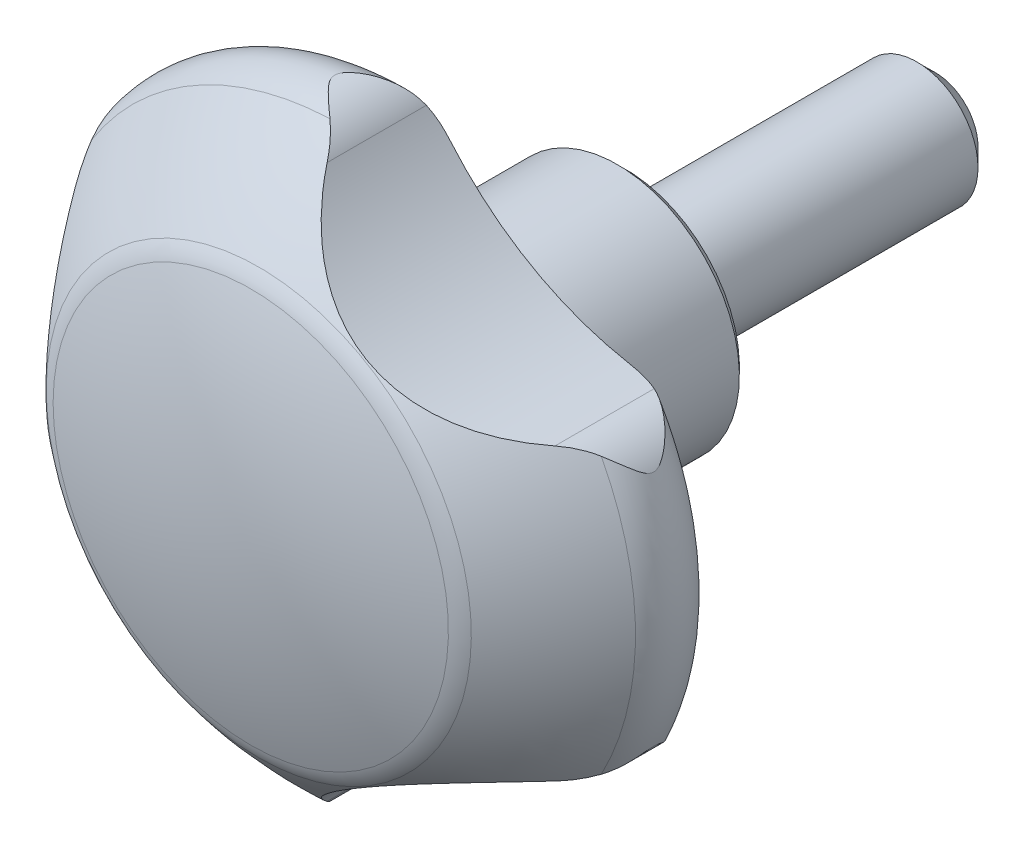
ISO-10303-21;
HEADER;
FILE_DESCRIPTION(('STEP AP214'),'2;1');
FILE_NAME('part.step','',(''),(''),'','','');
FILE_SCHEMA(('AUTOMOTIVE_DESIGN { 1 0 10303 214 1 1 1 1 }'));
ENDSEC;
DATA;
#1=APPLICATION_CONTEXT('core data for automotive mechanical design processes');
#2=APPLICATION_PROTOCOL_DEFINITION('international standard','automotive_design',2000,#1);
#3=PRODUCT_CONTEXT('',#1,'mechanical');
#4=PRODUCT('Part','Part','',(#3));
#5=PRODUCT_RELATED_PRODUCT_CATEGORY('part','',(#4));
#6=PRODUCT_DEFINITION_FORMATION('','',#4);
#7=PRODUCT_DEFINITION_CONTEXT('part definition',#1,'design');
#8=PRODUCT_DEFINITION('design','',#6,#7);
#9=PRODUCT_DEFINITION_SHAPE('','',#8);
#10=(LENGTH_UNIT() NAMED_UNIT(*) SI_UNIT(.MILLI.,.METRE.));
#11=(NAMED_UNIT(*) PLANE_ANGLE_UNIT() SI_UNIT($,.RADIAN.));
#12=(NAMED_UNIT(*) SI_UNIT($,.STERADIAN.) SOLID_ANGLE_UNIT());
#13=UNCERTAINTY_MEASURE_WITH_UNIT(LENGTH_MEASURE(1.E-05),#10,'distance_accuracy_value','');
#14=(GEOMETRIC_REPRESENTATION_CONTEXT(3) GLOBAL_UNCERTAINTY_ASSIGNED_CONTEXT((#13)) GLOBAL_UNIT_ASSIGNED_CONTEXT((#10,
#11,#12)) REPRESENTATION_CONTEXT('',''));
#15=CARTESIAN_POINT('',(0.,0.,0.));
#16=DIRECTION('',(0.,0.,1.));
#17=DIRECTION('',(1.,0.,0.));
#18=AXIS2_PLACEMENT_3D('',#15,#16,#17);
#19=CARTESIAN_POINT('',(0.,0.,16.875));
#20=DIRECTION('',(0.,0.,1.));
#21=DIRECTION('',(0.,-1.,0.));
#22=AXIS2_PLACEMENT_3D('',#19,#20,#21);
#23=TOROIDAL_SURFACE('',#22,16.625,3.375);
#24=CARTESIAN_POINT('',(0.,0.,13.5));
#25=DIRECTION('',(0.,0.,1.));
#26=DIRECTION('',(0.,-1.,0.));
#27=AXIS2_PLACEMENT_3D('',#24,#25,#26);
#28=CIRCLE('',#27,16.625);
#29=CARTESIAN_POINT('',(-15.1822150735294,-6.77428745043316,13.5));
#30=VERTEX_POINT('',#29);
#31=CARTESIAN_POINT('',(1.72440251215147,-16.5353276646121,13.5));
#32=VERTEX_POINT('',#31);
#33=EDGE_CURVE('E356',#30,#32,#28,.T.);
#34=ORIENTED_EDGE('',*,*,#33,.T.);
#35=CARTESIAN_POINT('',(15.4379786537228,-9.50595479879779,13.8541043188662));
#36=CARTESIAN_POINT('',(15.3037212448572,-9.51645099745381,13.7998826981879));
#37=CARTESIAN_POINT('',(15.1669261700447,-9.5285522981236,13.7526191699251));
#38=CARTESIAN_POINT('',(14.8901147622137,-9.55598611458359,13.6711535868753));
#39=CARTESIAN_POINT('',(14.7501059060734,-9.57131169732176,13.636923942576));
#40=CARTESIAN_POINT('',(14.4703418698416,-9.60499380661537,13.5808904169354));
#41=CARTESIAN_POINT('',(14.3306169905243,-9.62329916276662,13.5589005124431));
#42=CARTESIAN_POINT('',(14.0503009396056,-9.66307090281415,13.5254626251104));
#43=CARTESIAN_POINT('',(13.9097092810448,-9.68453925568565,13.5140212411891));
#44=CARTESIAN_POINT('',(13.5604307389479,-9.74171564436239,13.4973647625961));
#45=CARTESIAN_POINT('',(13.3517720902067,-9.77928160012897,13.4978565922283));
#46=CARTESIAN_POINT('',(12.9364664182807,-9.86087598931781,13.5161913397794));
#47=CARTESIAN_POINT('',(12.7298209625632,-9.90490908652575,13.5340468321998));
#48=CARTESIAN_POINT('',(12.3174684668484,-9.999577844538,13.5840167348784));
#49=CARTESIAN_POINT('',(12.1117957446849,-10.0502797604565,13.6162832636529));
#50=CARTESIAN_POINT('',(11.7042001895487,-10.1575906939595,13.6918190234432));
#51=CARTESIAN_POINT('',(11.5022759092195,-10.214197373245,13.7350839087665));
#52=CARTESIAN_POINT('',(10.9825776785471,-10.3686503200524,13.8577332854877));
#53=CARTESIAN_POINT('',(10.6675934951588,-10.4709447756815,13.9432631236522));
#54=CARTESIAN_POINT('',(10.2004875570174,-10.63545399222,14.0771430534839));
#55=CARTESIAN_POINT('',(10.0455515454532,-10.6921878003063,14.1227415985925));
#56=CARTESIAN_POINT('',(9.73714627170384,-10.8094624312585,14.2140018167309));
#57=CARTESIAN_POINT('',(9.58367689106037,-10.870002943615,14.2596634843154));
#58=CARTESIAN_POINT('',(9.28009247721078,-10.9941316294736,14.3483981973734));
#59=CARTESIAN_POINT('',(9.12996163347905,-11.0576605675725,14.3914997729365));
#60=CARTESIAN_POINT('',(8.83034428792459,-11.1888108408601,14.473670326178));
#61=CARTESIAN_POINT('',(8.68085784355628,-11.2564325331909,14.5127389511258));
#62=CARTESIAN_POINT('',(8.38263736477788,-11.3958170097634,14.5843050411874));
#63=CARTESIAN_POINT('',(8.23390239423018,-11.4675701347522,14.6168170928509));
#64=CARTESIAN_POINT('',(7.93690468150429,-11.6154557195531,14.6727872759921));
#65=CARTESIAN_POINT('',(7.78864179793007,-11.6915867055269,14.6962484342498));
#66=CARTESIAN_POINT('',(7.53921789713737,-11.8236597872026,14.7262894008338));
#67=CARTESIAN_POINT('',(7.43781839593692,-11.8784750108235,14.7358536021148));
#68=CARTESIAN_POINT('',(7.23569510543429,-11.9900171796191,14.7491398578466));
#69=CARTESIAN_POINT('',(7.13497124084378,-12.0467439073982,14.7528625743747));
#70=CARTESIAN_POINT('',(6.93446874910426,-12.161968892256,14.7542555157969));
#71=CARTESIAN_POINT('',(6.83469034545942,-12.2204675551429,14.7519243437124));
#72=CARTESIAN_POINT('',(6.63639652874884,-12.3390439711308,14.7413391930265));
#73=CARTESIAN_POINT('',(6.53788114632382,-12.3991217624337,14.733085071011));
#74=CARTESIAN_POINT('',(6.34135670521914,-12.5213047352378,14.7109864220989));
#75=CARTESIAN_POINT('',(6.24336300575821,-12.5834243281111,14.6970858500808));
#76=CARTESIAN_POINT('',(6.04904039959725,-12.7089780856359,14.6643869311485));
#77=CARTESIAN_POINT('',(5.95271178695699,-12.7724124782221,14.6455877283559));
#78=CARTESIAN_POINT('',(5.66623604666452,-12.9646113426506,14.5830663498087));
#79=CARTESIAN_POINT('',(5.47866922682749,-13.0952277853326,14.5332294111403));
#80=CARTESIAN_POINT('',(5.15344663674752,-13.3299828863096,14.436931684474));
#81=CARTESIAN_POINT('',(5.01443996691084,-13.4331124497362,14.3924401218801));
#82=CARTESIAN_POINT('',(4.73971969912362,-13.642479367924,14.3006111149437));
#83=CARTESIAN_POINT('',(4.60400649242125,-13.7487170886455,14.2532733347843));
#84=CARTESIAN_POINT('',(4.3354008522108,-13.9646299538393,14.158085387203));
#85=CARTESIAN_POINT('',(4.20250995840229,-14.0743068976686,14.1102349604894));
#86=CARTESIAN_POINT('',(3.93928289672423,-14.2973419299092,14.0161154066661));
#87=CARTESIAN_POINT('',(3.80894682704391,-14.4107001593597,13.969846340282));
#88=CARTESIAN_POINT('',(3.42301483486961,-14.7552752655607,13.8368224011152));
#89=CARTESIAN_POINT('',(3.1707686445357,-14.9923790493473,13.7551864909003));
#90=CARTESIAN_POINT('',(2.67547480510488,-15.4831619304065,13.6198975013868));
#91=CARTESIAN_POINT('',(2.43241124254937,-15.7368100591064,13.5661937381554));
#92=CARTESIAN_POINT('',(1.9838165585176,-16.2307686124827,13.5051034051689));
#93=CARTESIAN_POINT('',(1.77713561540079,-16.4693787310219,13.4931932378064));
#94=CARTESIAN_POINT('',(1.47663315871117,-16.833363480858,13.5091853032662));
#95=CARTESIAN_POINT('',(1.37809953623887,-16.9556400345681,13.5201448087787));
#96=CARTESIAN_POINT('',(1.18481238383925,-17.2013258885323,13.5547877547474));
#97=CARTESIAN_POINT('',(1.09005659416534,-17.3247344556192,13.5784634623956));
#98=CARTESIAN_POINT('',(0.912640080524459,-17.5613943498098,13.6374382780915));
#99=CARTESIAN_POINT('',(0.82962387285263,-17.6746511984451,13.67162881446));
#100=CARTESIAN_POINT('',(0.667982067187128,-17.8999656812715,13.7529327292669));
#101=CARTESIAN_POINT('',(0.589364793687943,-18.0120207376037,13.8000696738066));
#102=CARTESIAN_POINT('',(0.513385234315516,-18.1226937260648,13.854121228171));
#103=B_SPLINE_CURVE_WITH_KNOTS('',3,(#35,#36,#37,#38,#39,#40,#41,#42,#43,#44,#45,#46,#47,#48,
#49,#50,#51,#52,#53,#54,#55,#56,#57,#58,#59,#60,#61,#62,#63,#64,#65,#66,#67,#68,#69,#70,#71,#72,
#73,#74,#75,#76,#77,#78,#79,#80,#81,#82,#83,#84,#85,#86,#87,#88,#89,#90,#91,#92,#93,#94,#95,#96,
#97,#98,#99,#100,#101,#102),.UNSPECIFIED.,.F.,.F.,(4,2,2,2,2,2,2,2,2,2,2,2,2,2,2,2,2,2,2,2,2,2,
2,2,2,2,2,2,2,2,2,2,2,4),(0.,0.43512627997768,0.869326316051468,1.29673327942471,
1.72440743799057,2.35940170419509,2.99485616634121,3.63718292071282,4.27925627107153,
5.30456736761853,5.81809451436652,6.33157982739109,6.83737353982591,7.34321145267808,
7.84791129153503,8.35244220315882,8.69928448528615,9.0460874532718,9.39297045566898,
9.73986185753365,10.0902839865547,10.4407673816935,11.1419829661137,11.6780504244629,
12.2141812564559,12.7505974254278,13.2870341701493,14.352982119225,15.4169890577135,
16.3615250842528,16.8333167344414,17.3048218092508,17.7377773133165,18.1715262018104),.UNSPECIFIED.);
#104=CARTESIAN_POINT('',(0.513522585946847,-18.1224937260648,13.8540235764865));
#105=VERTEX_POINT('',#104);
#106=EDGE_CURVE('E151',#32,#105,#103,.T.);
#107=ORIENTED_EDGE('',*,*,#106,.T.);
#108=CARTESIAN_POINT('',(-0.717939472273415,-19.2832689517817,18.9372857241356));
#109=CARTESIAN_POINT('',(-0.817379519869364,-19.3432731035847,18.8547399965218));
#110=CARTESIAN_POINT('',(-0.918151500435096,-19.398116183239,18.7701038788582));
#111=CARTESIAN_POINT('',(-1.12111838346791,-19.4978445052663,18.5964610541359));
#112=CARTESIAN_POINT('',(-1.22331497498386,-19.54271662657,18.5074487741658));
#113=CARTESIAN_POINT('',(-1.42803631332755,-19.6228738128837,18.3247102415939));
#114=CARTESIAN_POINT('',(-1.53056071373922,-19.6581193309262,18.2309663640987));
#115=CARTESIAN_POINT('',(-1.73342131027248,-19.7190945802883,18.0382837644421));
#116=CARTESIAN_POINT('',(-1.83375959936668,-19.7448338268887,17.9393503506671));
#117=CARTESIAN_POINT('',(-1.98769349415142,-19.7784352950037,17.7764481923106));
#118=CARTESIAN_POINT('',(-2.04336920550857,-19.7892799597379,17.7150560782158));
#119=CARTESIAN_POINT('',(-2.1509373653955,-19.8080166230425,17.5883778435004));
#120=CARTESIAN_POINT('',(-2.2028252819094,-19.8159051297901,17.5230872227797));
#121=CARTESIAN_POINT('',(-2.28824210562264,-19.8273856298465,17.4024525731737));
#122=CARTESIAN_POINT('',(-2.32325949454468,-19.8315471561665,17.348234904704));
#123=CARTESIAN_POINT('',(-2.38559924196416,-19.8382748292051,17.2354517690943));
#124=CARTESIAN_POINT('',(-2.41295244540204,-19.8408474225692,17.1769049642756));
#125=CARTESIAN_POINT('',(-2.44702989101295,-19.843843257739,17.0774131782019));
#126=CARTESIAN_POINT('',(-2.45763984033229,-19.8447083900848,17.0378537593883));
#127=CARTESIAN_POINT('',(-2.47204409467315,-19.8458612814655,16.957522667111));
#128=CARTESIAN_POINT('',(-2.47585221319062,-19.8461502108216,16.9167536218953));
#129=CARTESIAN_POINT('',(-2.47597002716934,-19.8461593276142,16.8350871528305));
#130=CARTESIAN_POINT('',(-2.4722582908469,-19.8458778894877,16.7941896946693));
#131=CARTESIAN_POINT('',(-2.45799116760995,-19.8447369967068,16.7136042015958));
#132=CARTESIAN_POINT('',(-2.4474231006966,-19.8438764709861,16.6739185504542));
#133=CARTESIAN_POINT('',(-2.41334831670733,-19.8408842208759,16.5739659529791));
#134=CARTESIAN_POINT('',(-2.38589258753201,-19.8383048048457,16.5151006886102));
#135=CARTESIAN_POINT('',(-2.32323417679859,-19.8315461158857,16.4016974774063));
#136=CARTESIAN_POINT('',(-2.28799501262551,-19.8273592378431,16.3471816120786));
#137=CARTESIAN_POINT('',(-2.1886918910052,-19.8139942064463,16.20698075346));
#138=CARTESIAN_POINT('',(-2.12082742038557,-19.8033419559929,16.1241785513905));
#139=CARTESIAN_POINT('',(-1.97976163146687,-19.7770498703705,15.9640107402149));
#140=CARTESIAN_POINT('',(-1.90654811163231,-19.7613983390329,15.8866584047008));
#141=CARTESIAN_POINT('',(-1.75721685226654,-19.7248160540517,15.7354479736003));
#142=CARTESIAN_POINT('',(-1.68108815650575,-19.703863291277,15.6616060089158));
#143=CARTESIAN_POINT('',(-1.52779044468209,-19.6565655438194,15.5169677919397));
#144=CARTESIAN_POINT('',(-1.45062246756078,-19.6302256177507,15.4461687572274));
#145=CARTESIAN_POINT('',(-1.26477673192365,-19.5601948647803,15.2789511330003));
#146=CARTESIAN_POINT('',(-1.15599265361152,-19.5137970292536,15.1837670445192));
#147=CARTESIAN_POINT('',(-0.939748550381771,-19.4096395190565,14.9980807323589));
#148=CARTESIAN_POINT('',(-0.832289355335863,-19.3518730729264,14.907581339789));
#149=CARTESIAN_POINT('',(-0.62074782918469,-19.224984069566,14.732076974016));
#150=CARTESIAN_POINT('',(-0.516650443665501,-19.155924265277,14.6470450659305));
#151=CARTESIAN_POINT('',(-0.31262734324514,-19.0059523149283,14.4826321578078));
#152=CARTESIAN_POINT('',(-0.21270125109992,-18.9250412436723,14.4032506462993));
#153=CARTESIAN_POINT('',(-0.00138552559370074,-18.7358270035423,14.2377558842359));
#154=CARTESIAN_POINT('',(0.10895095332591,-18.6252080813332,14.1528947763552));
#155=CARTESIAN_POINT('',(0.266841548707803,-18.4464783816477,14.0340195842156));
#156=CARTESIAN_POINT('',(0.318314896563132,-18.3846073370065,13.9957170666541));
#157=CARTESIAN_POINT('',(0.418305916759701,-18.2566207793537,13.9223190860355));
#158=CARTESIAN_POINT('',(0.466821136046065,-18.1905018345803,13.8872262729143));
#159=CARTESIAN_POINT('',(0.513659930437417,-18.1222937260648,13.8539259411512));
#160=B_SPLINE_CURVE_WITH_KNOTS('',3,(#108,#109,#110,#111,#112,#113,#114,#115,#116,#117,#118,
#119,#120,#121,#122,#123,#124,#125,#126,#127,#128,#129,#130,#131,#132,#133,#134,#135,#136,#137,
#138,#139,#140,#141,#142,#143,#144,#145,#146,#147,#148,#149,#150,#151,#152,#153,#154,#155,#156,
#157,#158,#159),.UNSPECIFIED.,.F.,.F.,(4,2,2,2,2,2,2,2,2,2,2,2,2,2,2,2,2,2,2,2,2,2,2,2,2,4),(0.,
0.427303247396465,0.855165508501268,1.28475989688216,1.71392311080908,1.96454616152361,
2.21546432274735,2.40917167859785,2.6020878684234,2.7245104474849,2.84668412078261,
2.96920648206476,3.09195608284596,3.28584534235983,3.48066345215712,3.80264995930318,
4.125395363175,4.44950335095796,4.77330838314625,5.22823004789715,5.68342350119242,
6.13616858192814,6.58887262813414,7.12078134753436,7.38799730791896,7.65543192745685),.UNSPECIFIED.);
#161=CARTESIAN_POINT('',(-0.718180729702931,-19.2834144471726,18.9370857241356));
#162=VERTEX_POINT('',#161);
#163=EDGE_CURVE('E146',#162,#105,#160,.T.);
#164=ORIENTED_EDGE('',*,*,#163,.F.);
#165=CARTESIAN_POINT('',(0.,0.,18.9370857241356));
#166=DIRECTION('',(0.,0.,1.));
#167=DIRECTION('',(0.,-1.,0.));
#168=AXIS2_PLACEMENT_3D('',#165,#166,#167);
#169=CIRCLE('',#168,19.2967835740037);
#170=CARTESIAN_POINT('',(-16.3408364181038,-10.2636699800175,18.9370857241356));
#171=VERTEX_POINT('',#170);
#172=EDGE_CURVE('E362',#171,#162,#169,.T.);
#173=ORIENTED_EDGE('',*,*,#172,.F.);
#174=CARTESIAN_POINT('',(-15.9512057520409,-8.61632325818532,13.85393438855));
#175=CARTESIAN_POINT('',(-16.0093028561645,-8.737994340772,13.9082231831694));
#176=CARTESIAN_POINT('',(-16.060350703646,-8.86072630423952,13.9672208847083));
#177=CARTESIAN_POINT('',(-16.14897200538,-9.10667626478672,14.0931003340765));
#178=CARTESIAN_POINT('',(-16.1865737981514,-9.22989267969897,14.1599651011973));
#179=CARTESIAN_POINT('',(-16.2490254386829,-9.47514620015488,14.2999689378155));
#180=CARTESIAN_POINT('',(-16.2739323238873,-9.59718611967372,14.3730781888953));
#181=CARTESIAN_POINT('',(-16.312066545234,-9.83966938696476,14.5248830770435));
#182=CARTESIAN_POINT('',(-16.3252874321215,-9.96011181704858,14.6035817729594));
#183=CARTESIAN_POINT('',(-16.3414570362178,-10.2078052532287,14.7722047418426));
#184=CARTESIAN_POINT('',(-16.3435129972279,-10.334843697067,14.8625247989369));
#185=CARTESIAN_POINT('',(-16.336009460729,-10.5848023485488,15.0482599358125));
#186=CARTESIAN_POINT('',(-16.3264474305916,-10.7077216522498,15.1436761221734));
#187=CARTESIAN_POINT('',(-16.2969095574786,-10.9479894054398,15.3394481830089));
#188=CARTESIAN_POINT('',(-16.2769460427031,-11.0653442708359,15.4397980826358));
#189=CARTESIAN_POINT('',(-16.2281050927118,-11.2928347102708,15.646235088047));
#190=CARTESIAN_POINT('',(-16.1992353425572,-11.4029764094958,15.7523171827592));
#191=CARTESIAN_POINT('',(-16.1493571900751,-11.5664047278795,15.9245079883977));
#192=CARTESIAN_POINT('',(-16.1304655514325,-11.6234147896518,15.9877083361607));
#193=CARTESIAN_POINT('',(-16.0916521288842,-11.7327235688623,16.1179814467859));
#194=CARTESIAN_POINT('',(-16.0717293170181,-11.7850174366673,16.1850580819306));
#195=CARTESIAN_POINT('',(-16.0366015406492,-11.8722875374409,16.3108301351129));
#196=CARTESIAN_POINT('',(-16.0212499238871,-11.9086355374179,16.3685187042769));
#197=CARTESIAN_POINT('',(-15.9929667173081,-11.9733734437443,16.4887986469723));
#198=CARTESIAN_POINT('',(-15.9800259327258,-12.0017938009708,16.5513700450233));
#199=CARTESIAN_POINT('',(-15.9639727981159,-12.0363977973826,16.6554709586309));
#200=CARTESIAN_POINT('',(-15.9590035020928,-12.046924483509,16.6952167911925));
#201=CARTESIAN_POINT('',(-15.9519431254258,-12.0618077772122,16.7760642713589));
#202=CARTESIAN_POINT('',(-15.9498449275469,-12.0661796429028,16.8171623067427));
#203=CARTESIAN_POINT('',(-15.9489671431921,-12.0680139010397,16.8997426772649));
#204=CARTESIAN_POINT('',(-15.9502024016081,-12.0654453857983,16.9412259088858));
#205=CARTESIAN_POINT('',(-15.9557420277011,-12.0538107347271,17.0230710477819));
#206=CARTESIAN_POINT('',(-15.9600518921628,-12.0447329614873,17.0634308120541));
#207=CARTESIAN_POINT('',(-15.9737226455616,-12.0154681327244,17.1624272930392));
#208=CARTESIAN_POINT('',(-15.9845397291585,-11.9919731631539,17.2198462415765));
#209=CARTESIAN_POINT('',(-16.0087265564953,-11.9375757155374,17.3305586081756));
#210=CARTESIAN_POINT('',(-16.0221088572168,-11.9066365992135,17.3838298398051));
#211=CARTESIAN_POINT('',(-16.0584086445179,-11.8191710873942,17.519682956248));
#212=CARTESIAN_POINT('',(-16.0820171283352,-11.7588131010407,17.5995627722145));
#213=CARTESIAN_POINT('',(-16.1279945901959,-11.6311833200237,17.7540647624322));
#214=CARTESIAN_POINT('',(-16.1503604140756,-11.5638950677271,17.8286736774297));
#215=CARTESIAN_POINT('',(-16.1924155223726,-11.4243786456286,17.9744739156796));
#216=CARTESIAN_POINT('',(-16.2120945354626,-11.3521330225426,18.0456514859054));
#217=CARTESIAN_POINT('',(-16.2477973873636,-11.2041859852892,18.1850918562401));
#218=CARTESIAN_POINT('',(-16.2638251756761,-11.128488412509,18.2533577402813));
#219=CARTESIAN_POINT('',(-16.2891263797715,-10.9885286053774,18.3750655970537));
#220=CARTESIAN_POINT('',(-16.299100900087,-10.924743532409,18.4289123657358));
#221=CARTESIAN_POINT('',(-16.3160522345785,-10.7955359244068,18.5351218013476));
#222=CARTESIAN_POINT('',(-16.3230284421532,-10.7301130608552,18.5874841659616));
#223=CARTESIAN_POINT('',(-16.333731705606,-10.5984731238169,18.6902701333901));
#224=CARTESIAN_POINT('',(-16.3374881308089,-10.5322689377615,18.7407071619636));
#225=CARTESIAN_POINT('',(-16.3416872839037,-10.3986743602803,18.8401076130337));
#226=CARTESIAN_POINT('',(-16.3421304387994,-10.3312841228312,18.8890712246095));
#227=CARTESIAN_POINT('',(-16.340831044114,-10.2633882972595,18.9372857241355));
#228=B_SPLINE_CURVE_WITH_KNOTS('',3,(#174,#175,#176,#177,#178,#179,#180,#181,#182,#183,#184,
#185,#186,#187,#188,#189,#190,#191,#192,#193,#194,#195,#196,#197,#198,#199,#200,#201,#202,#203,
#204,#205,#206,#207,#208,#209,#210,#211,#212,#213,#214,#215,#216,#217,#218,#219,#220,#221,#222,
#223,#224,#225,#226,#227),.UNSPECIFIED.,.F.,.F.,(4,2,2,2,2,2,2,2,2,2,2,2,2,2,2,2,2,2,2,2,2,2,2,
2,2,2,4),(0.,0.435551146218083,0.870178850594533,1.30283619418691,1.73573216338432,
2.20278289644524,2.66993546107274,3.13653559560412,3.60273422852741,3.86416270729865,
4.12585701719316,4.33521208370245,4.54375156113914,4.66753533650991,4.79101170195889,
4.91503885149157,5.03928829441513,5.22712917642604,5.41591418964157,5.72375561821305,
6.03234572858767,6.34208434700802,6.65148631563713,6.9036125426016,7.15578975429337,
7.4056414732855,7.6554609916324),.UNSPECIFIED.);
#229=CARTESIAN_POINT('',(-15.9513012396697,-8.61652325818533,13.8540235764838));
#230=VERTEX_POINT('',#229);
#231=EDGE_CURVE('E141',#230,#171,#228,.T.);
#232=ORIENTED_EDGE('',*,*,#231,.F.);
#233=CARTESIAN_POINT('',(-15.9513967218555,-8.61672325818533,13.8541127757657));
#234=CARTESIAN_POINT('',(-15.8933579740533,-8.49520512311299,13.7998904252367));
#235=CARTESIAN_POINT('',(-15.8354404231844,-8.3706867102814,13.7526261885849));
#236=CARTESIAN_POINT('',(-15.7207929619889,-8.11724451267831,13.6711592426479));
#237=CARTESIAN_POINT('',(-15.6640607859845,-7.98833066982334,13.6369289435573));
#238=CARTESIAN_POINT('',(-15.553348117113,-7.72920714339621,13.5808941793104));
#239=CARTESIAN_POINT('',(-15.4993384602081,-7.5990492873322,13.5589036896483));
#240=CARTESIAN_POINT('',(-15.3936235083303,-7.33640278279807,13.5254646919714));
#241=CARTESIAN_POINT('',(-15.3419196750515,-7.20391272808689,13.5140227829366));
#242=CARTESIAN_POINT('',(-15.2167967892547,-6.87284203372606,13.4973651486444));
#243=CARTESIAN_POINT('',(-15.1450008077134,-6.67335688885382,13.4978562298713));
#244=CARTESIAN_POINT('',(-15.0080112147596,-6.27289743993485,13.516189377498));
#245=CARTESIAN_POINT('',(-14.9428224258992,-6.07192216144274,13.5340440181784));
#246=CARTESIAN_POINT('',(-14.8186319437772,-5.66748299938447,13.58401216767));
#247=CARTESIAN_POINT('',(-14.7597047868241,-5.46401570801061,13.6162777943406));
#248=CARTESIAN_POINT('',(-14.648841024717,-5.05737505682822,13.6918117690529));
#249=CARTESIAN_POINT('',(-14.59690167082,-4.85420161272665,13.7350757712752));
#250=CARTESIAN_POINT('',(-14.4708109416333,-4.32690041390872,13.8577245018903));
#251=CARTESIAN_POINT('',(-14.4019069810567,-4.00296459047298,13.9432550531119));
#252=CARTESIAN_POINT('',(-14.310821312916,-3.51617796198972,14.0771364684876));
#253=CARTESIAN_POINT('',(-14.2824856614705,-3.35363039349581,14.1227355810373));
#254=CARTESIAN_POINT('',(-14.2298448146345,-3.02790199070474,14.2139970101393));
#255=CARTESIAN_POINT('',(-14.2055392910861,-2.86472120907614,14.25965932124));
#256=CARTESIAN_POINT('',(-14.1612448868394,-2.53974081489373,14.3483953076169));
#257=CARTESIAN_POINT('',(-14.1411967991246,-2.37795712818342,14.3914975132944));
#258=CARTESIAN_POINT('',(-14.1049670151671,-2.05290153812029,14.4736692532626));
#259=CARTESIAN_POINT('',(-14.0887856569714,-1.88962950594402,14.5127384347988));
#260=CARTESIAN_POINT('',(-14.0603855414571,-1.56166647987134,14.584305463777));
#261=CARTESIAN_POINT('',(-14.0481579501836,-1.39697950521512,14.6168178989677));
#262=CARTESIAN_POINT('',(-14.0277316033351,-1.06582480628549,14.6727885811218));
#263=CARTESIAN_POINT('',(-14.0195315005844,-0.899357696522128,14.6962498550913));
#264=CARTESIAN_POINT('',(-14.0091982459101,-0.617310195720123,14.726290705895));
#265=CARTESIAN_POINT('',(-14.0059699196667,-0.502086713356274,14.735854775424));
#266=CARTESIAN_POINT('',(-14.0015067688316,-0.271269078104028,14.7491406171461));
#267=CARTESIAN_POINT('',(-14.0002717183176,-0.155674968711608,14.7528630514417));
#268=CARTESIAN_POINT('',(-13.9998084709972,0.0755804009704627,14.7542552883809));
#269=CARTESIAN_POINT('',(-14.0005807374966,0.1912416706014,14.7519236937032));
#270=CARTESIAN_POINT('',(-14.0041243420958,0.422259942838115,14.7413375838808));
#271=CARTESIAN_POINT('',(-14.0068957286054,0.537616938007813,14.7330829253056));
#272=CARTESIAN_POINT('',(-14.0144474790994,0.768906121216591,14.710983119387));
#273=CARTESIAN_POINT('',(-14.0192480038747,0.884832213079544,14.6970819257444));
#274=CARTESIAN_POINT('',(-14.0308199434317,1.11589989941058,14.6643817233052));
#275=CARTESIAN_POINT('',(-14.0375917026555,1.23104135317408,14.6455818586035));
#276=CARTESIAN_POINT('',(-14.0608038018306,1.57523971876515,14.5830584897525));
#277=CARTESIAN_POINT('',(-14.0801382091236,1.80298796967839,14.5332202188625));
#278=CARTESIAN_POINT('',(-14.12083142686,2.20201415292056,14.4369219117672));
#279=CARTESIAN_POINT('',(-14.1406406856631,2.37395752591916,14.3924312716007));
#280=CARTESIAN_POINT('',(-14.1845969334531,2.71654638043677,14.3006044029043));
#281=CARTESIAN_POINT('',(-14.2087444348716,2.88719170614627,14.253267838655));
#282=CARTESIAN_POINT('',(-14.2614264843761,3.22775824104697,14.1580824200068));
#283=CARTESIAN_POINT('',(-14.2899633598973,3.39767901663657,14.1102333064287));
#284=CARTESIAN_POINT('',(-14.3515021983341,3.73714870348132,14.0161162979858));
#285=CARTESIAN_POINT('',(-14.3845043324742,3.90669760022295,13.9698484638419));
#286=CARTESIAN_POINT('',(-14.4899459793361,4.41319851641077,13.8368278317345));
#287=CARTESIAN_POINT('',(-14.5691582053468,4.75019302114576,13.755193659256));
#288=CARTESIAN_POINT('',(-14.7465355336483,5.42450354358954,13.6199060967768));
#289=CARTESIAN_POINT('',(-14.8446658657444,5.76181785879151,13.5662020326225));
#290=CARTESIAN_POINT('',(-15.0481450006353,6.39728605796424,13.5051069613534));
#291=CARTESIAN_POINT('',(-15.1514470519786,6.69558548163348,13.4931939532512));
#292=CARTESIAN_POINT('',(-15.3164163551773,7.13782595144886,13.509181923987));
#293=CARTESIAN_POINT('',(-15.3730443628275,7.28429865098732,13.5201400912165));
#294=CARTESIAN_POINT('',(-15.4891715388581,7.5745368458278,13.5547804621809));
#295=CARTESIAN_POINT('',(-15.5486689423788,7.71830393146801,13.5784549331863));
#296=CARTESIAN_POINT('',(-15.6649160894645,7.99028741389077,13.6374281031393));
#297=CARTESIAN_POINT('',(-15.7214928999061,8.11881435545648,13.671618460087));
#298=CARTESIAN_POINT('',(-15.8358034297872,8.37146611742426,13.7529227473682));
#299=CARTESIAN_POINT('',(-15.8935390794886,8.49558243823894,13.8000602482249));
#300=CARTESIAN_POINT('',(-15.9513967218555,8.61672325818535,13.8541127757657));
#301=B_SPLINE_CURVE_WITH_KNOTS('',3,(#233,#234,#235,#236,#237,#238,#239,#240,#241,#242,#243,
#244,#245,#246,#247,#248,#249,#250,#251,#252,#253,#254,#255,#256,#257,#258,#259,#260,#261,#262,
#263,#264,#265,#266,#267,#268,#269,#270,#271,#272,#273,#274,#275,#276,#277,#278,#279,#280,#281,
#282,#283,#284,#285,#286,#287,#288,#289,#290,#291,#292,#293,#294,#295,#296,#297,#298,#299,#300),
.UNSPECIFIED.,.F.,.F.,(4,2,2,2,2,2,2,2,2,2,2,2,2,2,2,2,2,2,2,2,2,2,2,2,2,2,2,2,2,2,2,2,2,4),(0.,
0.435126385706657,0.869326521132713,1.29673356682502,1.72440780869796,2.35939750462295,
2.99484738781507,3.6371695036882,4.27923821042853,5.30456286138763,5.81809684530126,
6.33158899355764,6.83738933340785,7.34323387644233,7.84794026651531,8.35247771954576,
8.69932392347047,9.04613081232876,9.39301775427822,9.73991309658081,10.0903392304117,
10.440826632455,11.1420502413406,11.6781033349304,12.2142197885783,12.7506215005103,
13.2870437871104,14.3529633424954,15.416942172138,16.3614882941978,16.8332849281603,
17.3047949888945,17.7377638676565,18.1715262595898),.UNSPECIFIED.);
#302=EDGE_CURVE('E132',#230,#30,#301,.T.);
#303=ORIENTED_EDGE('',*,*,#302,.T.);
#304=EDGE_LOOP('',(#34,#107,#164,#173,#232,#303));
#305=FACE_BOUND('',#304,.T.);
#306=ADVANCED_FACE('F14',(#305),#23,.T.);
#307=CARTESIAN_POINT('',(0.513659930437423,18.1222937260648,13.8539259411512));
#308=CARTESIAN_POINT('',(0.437338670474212,18.2334434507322,13.9082142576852));
#309=CARTESIAN_POINT('',(0.356573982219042,18.3390187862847,13.967211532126));
#310=CARTESIAN_POINT('',(0.187886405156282,18.5387433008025,14.0930902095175));
#311=CARTESIAN_POINT('',(0.0999790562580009,18.6329162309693,14.1599546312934));
#312=CARTESIAN_POINT('',(-0.0811903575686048,18.8096288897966,14.2999578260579));
#313=CARTESIAN_POINT('',(-0.174426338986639,18.8922194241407,14.3730667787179));
#314=CARTESIAN_POINT('',(-0.365355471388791,19.0464874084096,14.5248711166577));
#315=CARTESIAN_POINT('',(-0.463051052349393,19.1181588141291,14.6035695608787));
#316=CARTESIAN_POINT('',(-0.66947455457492,19.256009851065,14.7721918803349));
#317=CARTESIAN_POINT('',(-0.778464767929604,19.3213100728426,14.8625115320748));
#318=CARTESIAN_POINT('',(-0.998686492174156,19.4397921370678,15.0482458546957));
#319=CARTESIAN_POINT('',(-1.10991848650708,19.4929713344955,15.1436616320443));
#320=CARTESIAN_POINT('',(-1.33276498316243,19.587525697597,15.3394328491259));
#321=CARTESIAN_POINT('',(-1.44437887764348,19.6289147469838,15.4397823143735));
#322=CARTESIAN_POINT('',(-1.66581169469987,19.7003635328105,15.6462183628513));
#323=CARTESIAN_POINT('',(-1.77563207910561,19.7304329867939,15.7522999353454));
#324=CARTESIAN_POINT('',(-1.94210548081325,19.768952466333,15.9244907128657));
#325=CARTESIAN_POINT('',(-2.0009245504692,19.7810973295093,15.9876916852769));
#326=CARTESIAN_POINT('',(-2.1149977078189,19.8021391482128,16.1179660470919));
#327=CARTESIAN_POINT('',(-2.17024810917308,19.8110327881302,16.1850433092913));
#328=CARTESIAN_POINT('',(-2.26339292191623,19.8242469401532,16.3108172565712));
#329=CARTESIAN_POINT('',(-2.30254856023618,19.8291263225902,16.3685071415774));
#330=CARTESIAN_POINT('',(-2.37275774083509,19.8370017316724,16.4887899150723));
#331=CARTESIAN_POINT('',(-2.4038422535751,19.8400050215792,16.5513628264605));
#332=CARTESIAN_POINT('',(-2.44183813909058,19.8434047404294,16.6554654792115));
#333=CARTESIAN_POINT('',(-2.45343948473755,19.8443645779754,16.6952113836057));
#334=CARTESIAN_POINT('',(-2.46985963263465,19.8456918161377,16.7760590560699));
#335=CARTESIAN_POINT('',(-2.47469520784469,19.846060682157,16.8171572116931));
#336=CARTESIAN_POINT('',(-2.47672322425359,19.8462176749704,16.8997379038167));
#337=CARTESIAN_POINT('',(-2.47388147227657,19.8460032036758,16.9412213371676));
#338=CARTESIAN_POINT('',(-2.46103620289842,19.8449833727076,17.0230669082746));
#339=CARTESIAN_POINT('',(-2.45101985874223,19.8441769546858,17.0634269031));
#340=CARTESIAN_POINT('',(-2.41884096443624,19.8413838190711,17.1624231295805));
#341=CARTESIAN_POINT('',(-2.39308569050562,19.8390042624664,17.2198416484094));
#342=CARTESIAN_POINT('',(-2.33388374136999,19.8327520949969,17.3305532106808));
#343=CARTESIAN_POINT('',(-2.30039905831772,19.8288720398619,17.3838240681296));
#344=CARTESIAN_POINT('',(-2.20650345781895,19.8165761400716,17.5196758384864));
#345=CARTESIAN_POINT('',(-2.14242883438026,19.8068429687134,17.599554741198));
#346=CARTESIAN_POINT('',(-2.00891180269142,19.7828464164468,17.7540549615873));
#347=CARTESIAN_POINT('',(-1.93945671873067,19.7685720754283,17.8286630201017));
#348=CARTESIAN_POINT('',(-1.79760669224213,19.7352356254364,17.9744615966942));
#349=CARTESIAN_POINT('',(-1.72520176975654,19.7161558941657,18.0456383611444));
#350=CARTESIAN_POINT('',(-1.57922667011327,19.6731032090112,18.1850771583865));
#351=CARTESIAN_POINT('',(-1.50565784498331,19.6491355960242,18.2533422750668));
#352=CARTESIAN_POINT('',(-1.37179807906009,19.6010677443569,18.3750509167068));
#353=CARTESIAN_POINT('',(-1.31156981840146,19.5778131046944,18.4288991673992));
#354=CARTESIAN_POINT('',(-1.19119404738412,19.5278888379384,18.5351114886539));
#355=CARTESIAN_POINT('',(-1.13104655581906,19.5012185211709,18.587475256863));
#356=CARTESIAN_POINT('',(-1.01168839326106,19.44466678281,18.6902639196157));
#357=CARTESIAN_POINT('',(-0.952474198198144,19.4148172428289,18.7407022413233));
#358=CARTESIAN_POINT('',(-0.834675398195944,19.3516551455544,18.8401052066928));
#359=CARTESIAN_POINT('',(-0.776090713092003,19.318343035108,18.8890700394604));
#360=CARTESIAN_POINT('',(-0.717939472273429,19.2832689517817,18.9372857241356));
#361=B_SPLINE_CURVE_WITH_KNOTS('',3,(#307,#308,#309,#310,#311,#312,#313,#314,#315,#316,#317,
#318,#319,#320,#321,#322,#323,#324,#325,#326,#327,#328,#329,#330,#331,#332,#333,#334,#335,#336,
#337,#338,#339,#340,#341,#342,#343,#344,#345,#346,#347,#348,#349,#350,#351,#352,#353,#354,#355,
#356,#357,#358,#359,#360),.UNSPECIFIED.,.F.,.F.,(4,2,2,2,2,2,2,2,2,2,2,2,2,2,2,2,2,2,2,2,2,2,2,
2,2,2,4),(0.,0.435551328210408,0.870179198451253,1.3028365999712,1.73573263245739,
2.20278258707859,2.66993436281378,3.13653373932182,3.60273163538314,3.86416387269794,
4.12586198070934,4.33522294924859,4.54376827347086,4.66755253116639,4.7910293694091,
4.91505705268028,5.03930702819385,5.22714611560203,5.41592931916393,5.72376636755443,
6.03235208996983,6.34208636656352,6.65148399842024,6.90361654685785,7.1558000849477,
7.40565794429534,7.65548359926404),.UNSPECIFIED.);
#362=CARTESIAN_POINT('',(0.513522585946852,18.1224937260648,13.854023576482));
#363=VERTEX_POINT('',#362);
#364=CARTESIAN_POINT('',(-0.718180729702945,19.2834144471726,18.9370857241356));
#365=VERTEX_POINT('',#364);
#366=EDGE_CURVE('E276',#363,#365,#361,.T.);
#367=ORIENTED_EDGE('',*,*,#366,.F.);
#368=CARTESIAN_POINT('',(0.513385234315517,18.1226937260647,13.854121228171));
#369=CARTESIAN_POINT('',(0.589603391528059,18.0116717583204,13.7998981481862));
#370=CARTESIAN_POINT('',(0.668480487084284,17.8992545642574,13.7526332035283));
#371=CARTESIAN_POINT('',(0.830643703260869,17.6732459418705,13.6711648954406));
#372=CARTESIAN_POINT('',(0.913920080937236,17.5596575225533,13.6369339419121));
#373=CARTESIAN_POINT('',(1.08297094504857,17.3342157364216,13.5808979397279));
#374=CARTESIAN_POINT('',(1.16868596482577,17.2223630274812,13.5589068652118));
#375=CARTESIAN_POINT('',(1.34328674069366,16.9994878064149,13.5254667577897));
#376=CARTESIAN_POINT('',(1.43217444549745,16.888465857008,13.5140243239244));
#377=CARTESIAN_POINT('',(1.65632734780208,16.6145718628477,13.4973655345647));
#378=CARTESIAN_POINT('',(1.79318737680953,16.4526531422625,13.4978558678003));
#379=CARTESIAN_POINT('',(2.07149824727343,16.1337888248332,13.5161874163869));
#380=CARTESIAN_POINT('',(2.21295234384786,15.9768469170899,13.5340412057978));
#381=CARTESIAN_POINT('',(2.50110924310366,15.6670768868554,13.5840076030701));
#382=CARTESIAN_POINT('',(2.6478522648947,15.5143116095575,13.6162723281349));
#383=CARTESIAN_POINT('',(2.94457900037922,15.214981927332,13.6918045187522));
#384=CARTESIAN_POINT('',(3.09456141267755,15.0684150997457,13.7350676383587));
#385=CARTESIAN_POINT('',(3.48817385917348,14.6955637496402,13.8577157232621));
#386=CARTESIAN_POINT('',(3.73426151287,14.473919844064,13.9432469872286));
#387=CARTESIAN_POINT('',(4.1102928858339,14.151639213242,14.0771298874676));
#388=CARTESIAN_POINT('',(4.23689695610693,14.0458244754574,14.122729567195));
#389=CARTESIAN_POINT('',(4.49266880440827,13.8373689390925,14.2139922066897));
#390=CARTESIAN_POINT('',(4.62183637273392,13.7347278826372,14.259655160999));
#391=CARTESIAN_POINT('',(4.88113371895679,13.5338748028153,14.348392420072));
#392=CARTESIAN_POINT('',(5.01122009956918,13.4356194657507,14.3914952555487));
#393=CARTESIAN_POINT('',(5.27461497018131,13.2417131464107,14.4736681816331));
#394=CARTESIAN_POINT('',(5.40792374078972,13.1460623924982,14.5127379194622));
#395=CARTESIAN_POINT('',(5.67775151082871,12.9574831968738,14.5843058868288));
#396=CARTESIAN_POINT('',(5.8142626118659,12.8645491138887,14.6168187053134));
#397=CARTESIAN_POINT('',(6.09084149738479,12.6812797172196,14.6727898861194));
#398=CARTESIAN_POINT('',(6.23090807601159,12.5909435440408,14.6962512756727));
#399=CARTESIAN_POINT('',(6.4700048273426,12.440969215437,14.7262920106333));
#400=CARTESIAN_POINT('',(6.56817829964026,12.3805610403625,14.735855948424));
#401=CARTESIAN_POINT('',(6.76584302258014,12.2612858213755,14.7491413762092));
#402=CARTESIAN_POINT('',(6.86533412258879,12.2024186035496,14.7528635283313));
#403=CARTESIAN_POINT('',(7.06537791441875,12.0863886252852,14.7542550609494));
#404=CARTESIAN_POINT('',(7.16593084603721,12.0292262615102,14.7519230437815));
#405=CARTESIAN_POINT('',(7.36777273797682,11.9167849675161,14.7413359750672));
#406=CARTESIAN_POINT('',(7.46906171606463,11.8615060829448,14.733080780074));
#407=CARTESIAN_POINT('',(7.67314230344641,11.7524005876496,14.7109798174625));
#408=CARTESIAN_POINT('',(7.77593871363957,11.6985944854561,14.6970780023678));
#409=CARTESIAN_POINT('',(7.98183757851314,11.5930814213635,14.6643765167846));
#410=CARTESIAN_POINT('',(8.08494008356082,11.5413748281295,14.6455759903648));
#411=CARTESIAN_POINT('',(8.39463426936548,11.3893768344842,14.5830506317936));
#412=CARTESIAN_POINT('',(8.60153965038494,11.2922461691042,14.5332110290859));
#413=CARTESIAN_POINT('',(8.96745131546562,11.1279761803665,14.4369121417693));
#414=CARTESIAN_POINT('',(9.12625907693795,11.0591619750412,14.3924224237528));
#415=CARTESIAN_POINT('',(9.44491942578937,10.9259388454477,14.3005976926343));
#416=CARTESIAN_POINT('',(9.60477213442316,10.8615304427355,14.2532623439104));
#417=CARTESIAN_POINT('',(9.92604388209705,10.7368747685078,14.1580794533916));
#418=CARTESIAN_POINT('',(10.0874637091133,10.6766297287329,14.1102316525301));
#419=CARTESIAN_POINT('',(10.4122137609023,10.5601922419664,14.0161171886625));
#420=CARTESIAN_POINT('',(10.5755440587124,10.5039999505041,13.9698505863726));
#421=CARTESIAN_POINT('',(11.0668942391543,10.3420686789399,13.8368332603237));
#422=CARTESIAN_POINT('',(11.3983370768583,10.2421734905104,13.7552008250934));
#423=CARTESIAN_POINT('',(12.0709771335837,10.0586351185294,13.6199146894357));
#424=CARTESIAN_POINT('',(12.4121554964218,9.97496267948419,13.5662103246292));
#425=CARTESIAN_POINT('',(13.064219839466,9.83344579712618,13.50511051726));
#426=CARTESIAN_POINT('',(13.3742087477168,9.77375666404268,13.4931946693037));
#427=CARTESIAN_POINT('',(13.8396897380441,9.69550179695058,13.5091785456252));
#428=CARTESIAN_POINT('',(13.9948544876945,9.67130602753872,13.5201353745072));
#429=CARTESIAN_POINT('',(14.3042751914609,9.62675465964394,13.5547731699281));
#430=CARTESIAN_POINT('',(14.4585316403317,9.60639673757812,13.5784464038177));
#431=CARTESIAN_POINT('',(14.7522062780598,9.5710764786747,13.637417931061));
#432=CARTESIAN_POINT('',(14.8918068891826,9.55580916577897,13.6716081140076));
#433=CARTESIAN_POINT('',(15.1677741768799,9.52847771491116,13.7529127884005));
#434=CARTESIAN_POINT('',(15.3041344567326,9.51641949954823,13.8000508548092));
#435=CARTESIAN_POINT('',(15.4379787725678,9.50595478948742,13.8541043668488));
#436=B_SPLINE_CURVE_WITH_KNOTS('',3,(#368,#369,#370,#371,#372,#373,#374,#375,#376,#377,#378,
#379,#380,#381,#382,#383,#384,#385,#386,#387,#388,#389,#390,#391,#392,#393,#394,#395,#396,#397,
#398,#399,#400,#401,#402,#403,#404,#405,#406,#407,#408,#409,#410,#411,#412,#413,#414,#415,#416,
#417,#418,#419,#420,#421,#422,#423,#424,#425,#426,#427,#428,#429,#430,#431,#432,#433,#434,#435),
.UNSPECIFIED.,.F.,.F.,(4,2,2,2,2,2,2,2,2,2,2,2,2,2,2,2,2,2,2,2,2,2,2,2,2,2,2,2,2,2,2,2,2,4),(0.,
0.435126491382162,0.869326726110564,1.29673385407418,1.72440817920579,2.35939330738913,
2.99483861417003,3.63715609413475,4.27922015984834,5.30455835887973,5.81809917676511,
6.33159815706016,6.83740512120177,7.34325629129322,7.8479692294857,8.35251322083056,
8.69936334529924,9.04617415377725,9.39306503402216,9.73996431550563,10.090394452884,
10.4408858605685,11.1421174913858,11.67815622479,12.2142583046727,12.7506455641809,
13.2870533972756,14.3529445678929,15.416895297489,16.3614514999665,16.8332531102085,
17.3047681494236,17.7377504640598,18.1715264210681),.UNSPECIFIED.);
#437=CARTESIAN_POINT('',(1.72440251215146,16.5353276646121,13.5));
#438=VERTEX_POINT('',#437);
#439=EDGE_CURVE('E269',#363,#438,#436,.T.);
#440=ORIENTED_EDGE('',*,*,#439,.T.);
#441=CARTESIAN_POINT('',(-15.1822150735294,6.77428745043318,13.5));
#442=VERTEX_POINT('',#441);
#443=EDGE_CURVE('E129',#438,#442,#28,.T.);
#444=ORIENTED_EDGE('',*,*,#443,.T.);
#445=CARTESIAN_POINT('',(-15.9513012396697,8.61652325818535,13.8540235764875));
#446=VERTEX_POINT('',#445);
#447=EDGE_CURVE('E113',#442,#446,#301,.T.);
#448=ORIENTED_EDGE('',*,*,#447,.T.);
#449=CARTESIAN_POINT('',(-16.340831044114,10.2633882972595,18.9372857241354));
#450=CARTESIAN_POINT('',(-16.3430761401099,10.3795079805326,18.8547399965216));
#451=CARTESIAN_POINT('',(-16.3401856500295,10.4942006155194,18.7701038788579));
#452=CARTESIAN_POINT('',(-16.3250694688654,10.7198392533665,18.5964610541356));
#453=CARTESIAN_POINT('',(-16.3128315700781,10.8307801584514,18.5074487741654));
#454=CARTESIAN_POINT('',(-16.2798890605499,11.0481526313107,18.3247102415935));
#455=CARTESIAN_POINT('',(-16.2591503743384,11.1545641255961,18.2309663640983));
#456=CARTESIAN_POINT('',(-16.2105261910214,11.3607341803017,18.0382837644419));
#457=CARTESIAN_POINT('',(-16.1826478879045,11.4604993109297,17.9393503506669));
#458=CARTESIAN_POINT('',(-16.1347806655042,11.6106107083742,17.7764481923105));
#459=CARTESIAN_POINT('',(-16.116334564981,11.6642496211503,17.7150560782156));
#460=CARTESIAN_POINT('',(-16.0787769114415,11.7667747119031,17.5883778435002));
#461=CARTESIAN_POINT('',(-16.0596646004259,11.8156552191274,17.5230872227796));
#462=CARTESIAN_POINT('',(-16.0268985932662,11.8953686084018,17.4024525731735));
#463=CARTESIAN_POINT('',(-16.0129938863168,11.9277753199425,17.3482349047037));
#464=CARTESIAN_POINT('',(-15.9876503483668,11.9851269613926,17.235451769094));
#465=CARTESIAN_POINT('',(-15.9762016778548,12.0101018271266,17.1769049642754));
#466=CARTESIAN_POINT('',(-15.961757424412,12.0411116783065,17.0774131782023));
#467=CARTESIAN_POINT('',(-15.9572016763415,12.0507327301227,17.0378537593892));
#468=CARTESIAN_POINT('',(-15.9509979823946,12.063783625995,16.9575226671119));
#469=CARTESIAN_POINT('',(-15.949344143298,12.0672260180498,16.9167536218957));
#470=CARTESIAN_POINT('',(-15.9492931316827,12.0673326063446,16.8350871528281));
#471=CARTESIAN_POINT('',(-15.950905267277,12.0639774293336,16.7941896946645));
#472=CARTESIAN_POINT('',(-15.9570507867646,12.0510512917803,16.7136042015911));
#473=CARTESIAN_POINT('',(-15.9615895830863,12.0414688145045,16.673918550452));
#474=CARTESIAN_POINT('',(-15.9760356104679,12.0104630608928,16.5739659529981));
#475=CARTESIAN_POINT('',(-15.9875296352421,11.9853959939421,16.5151006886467));
#476=CARTESIAN_POINT('',(-16.0130056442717,11.9277528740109,16.4016974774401));
#477=CARTESIAN_POINT('',(-16.026999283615,11.895141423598,16.347181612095));
#478=CARTESIAN_POINT('',(-16.0650763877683,11.8024598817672,16.2069807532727));
#479=CARTESIAN_POINT('',(-16.0897835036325,11.7383614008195,16.1241785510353));
#480=CARTESIAN_POINT('',(-16.1375467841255,11.6030488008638,15.9640107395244));
#481=CARTESIAN_POINT('',(-16.1605989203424,11.5318182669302,15.8866584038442));
#482=CARTESIAN_POINT('',(-16.2035833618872,11.3842024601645,15.7354479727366));
#483=CARTESIAN_POINT('',(-16.2235020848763,11.3077966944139,15.6616060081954));
#484=CARTESIAN_POINT('',(-16.259189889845,11.15138810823,15.5169677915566));
#485=CARTESIAN_POINT('',(-16.2749628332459,11.0713887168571,15.4461687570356));
#486=CARTESIAN_POINT('',(-16.3072372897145,10.875426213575,15.2789511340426));
#487=CARTESIAN_POINT('',(-16.3214476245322,10.7580175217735,15.183767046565));
#488=CARTESIAN_POINT('',(-16.3393666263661,10.5186658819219,14.9980807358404));
#489=CARTESIAN_POINT('',(-16.3430690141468,10.3967202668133,14.9075813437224));
#490=CARTESIAN_POINT('',(-16.3389506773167,10.1500754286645,14.7320769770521));
#491=CARTESIAN_POINT('',(-16.3311918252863,10.0253945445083,14.6470450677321));
#492=CARTESIAN_POINT('',(-16.3033238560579,9.77371937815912,14.4826321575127));
#493=CARTESIAN_POINT('',(-16.2832158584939,9.64672530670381,14.4032506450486));
#494=CARTESIAN_POINT('',(-16.2250100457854,9.36911656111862,14.237757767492));
#495=CARTESIAN_POINT('',(-16.1843805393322,9.21825610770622,14.1528983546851));
#496=CARTESIAN_POINT('',(-16.1085436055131,8.99215875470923,14.0340253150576));
#497=CARTESIAN_POINT('',(-16.0806992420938,8.91664760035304,13.9957234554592));
#498=CARTESIAN_POINT('',(-16.019857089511,8.7660627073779,13.9223266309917));
#499=CARTESIAN_POINT('',(-15.9868551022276,8.69098937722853,13.8872343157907));
#500=CARTESIAN_POINT('',(-15.9512057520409,8.61632325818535,13.85393438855));
#501=B_SPLINE_CURVE_WITH_KNOTS('',3,(#449,#450,#451,#452,#453,#454,#455,#456,#457,#458,#459,
#460,#461,#462,#463,#464,#465,#466,#467,#468,#469,#470,#471,#472,#473,#474,#475,#476,#477,#478,
#479,#480,#481,#482,#483,#484,#485,#486,#487,#488,#489,#490,#491,#492,#493,#494,#495,#496,#497,
#498,#499,#500),.UNSPECIFIED.,.F.,.F.,(4,2,2,2,2,2,2,2,2,2,2,2,2,2,2,2,2,2,2,2,2,2,2,2,2,4),(0.,
0.427303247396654,0.855165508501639,1.28475989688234,1.71392311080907,1.9645461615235,
2.21546432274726,2.40917167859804,2.6020878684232,2.72451044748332,2.8466841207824,
2.96920648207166,3.09195608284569,3.2858453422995,3.48066345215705,3.80264995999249,
4.12539536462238,4.44950335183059,4.77330838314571,5.22823004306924,5.68342349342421,
6.13616858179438,6.58887262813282,7.12077015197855,7.38798041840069,7.65540932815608),.UNSPECIFIED.);
#502=CARTESIAN_POINT('',(-16.3408364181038,10.2636699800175,18.9370857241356));
#503=VERTEX_POINT('',#502);
#504=EDGE_CURVE('E102',#503,#446,#501,.T.);
#505=ORIENTED_EDGE('',*,*,#504,.F.);
#506=EDGE_CURVE('E360',#365,#503,#169,.T.);
#507=ORIENTED_EDGE('',*,*,#506,.F.);
#508=EDGE_LOOP('',(#367,#440,#444,#448,#505,#507));
#509=FACE_BOUND('',#508,.T.);
#510=ADVANCED_FACE('F126',(#509),#23,.T.);
#511=CARTESIAN_POINT('',(0.,0.,0.));
#512=DIRECTION('',(0.,0.,1.));
#513=DIRECTION('',(0.,-1.,0.));
#514=AXIS2_PLACEMENT_3D('',#511,#512,#513);
#515=PLANE('',#514);
#516=CARTESIAN_POINT('',(0.,0.,0.));
#517=DIRECTION('',(0.,0.,1.));
#518=DIRECTION('',(0.,-1.,0.));
#519=AXIS2_PLACEMENT_3D('',#516,#517,#518);
#520=CIRCLE('',#519,6.);
#521=CARTESIAN_POINT('',(0.,-6.,0.));
#522=VERTEX_POINT('',#521);
#523=EDGE_CURVE('E379',#522,#522,#520,.T.);
#524=ORIENTED_EDGE('',*,*,#523,.F.);
#525=EDGE_LOOP('',(#524));
#526=FACE_BOUND('',#525,.T.);
#527=CARTESIAN_POINT('',(0.,0.,0.));
#528=DIRECTION('',(0.,0.,1.));
#529=DIRECTION('',(0.,-1.,0.));
#530=AXIS2_PLACEMENT_3D('',#527,#528,#529);
#531=CIRCLE('',#530,4.);
#532=CARTESIAN_POINT('',(0.,-4.,0.));
#533=VERTEX_POINT('',#532);
#534=EDGE_CURVE('E282',#533,#533,#531,.T.);
#535=ORIENTED_EDGE('',*,*,#534,.T.);
#536=EDGE_LOOP('',(#535));
#537=FACE_BOUND('',#536,.T.);
#538=ADVANCED_FACE('F311',(#526,#537),#515,.F.);
#539=CARTESIAN_POINT('',(0.,0.,27.));
#540=DIRECTION('',(0.,0.,1.));
#541=DIRECTION('',(0.,-1.,0.));
#542=AXIS2_PLACEMENT_3D('',#539,#540,#541);
#543=CYLINDRICAL_SURFACE('',#542,6.);
#544=CARTESIAN_POINT('',(0.,0.,0.3));
#545=DIRECTION('',(0.,0.,1.));
#546=DIRECTION('',(0.,-1.,0.));
#547=AXIS2_PLACEMENT_3D('',#544,#545,#546);
#548=CIRCLE('',#547,6.);
#549=CARTESIAN_POINT('',(0.,-6.,0.3));
#550=VERTEX_POINT('',#549);
#551=EDGE_CURVE('E377',#550,#550,#548,.T.);
#552=ORIENTED_EDGE('',*,*,#551,.F.);
#553=EDGE_LOOP('',(#552));
#554=FACE_BOUND('',#553,.T.);
#555=ORIENTED_EDGE('',*,*,#523,.T.);
#556=EDGE_LOOP('',(#555));
#557=FACE_BOUND('',#556,.T.);
#558=ADVANCED_FACE('F397',(#554,#557),#543,.T.);
#559=CARTESIAN_POINT('',(6.,0.,0.3));
#560=DIRECTION('',(0.,0.,1.));
#561=DIRECTION('',(0.,-1.,0.));
#562=AXIS2_PLACEMENT_3D('',#559,#560,#561);
#563=PLANE('',#562);
#564=CARTESIAN_POINT('',(0.,0.,0.3));
#565=DIRECTION('',(0.,0.,1.));
#566=DIRECTION('',(0.,-1.,0.));
#567=AXIS2_PLACEMENT_3D('',#564,#565,#566);
#568=CIRCLE('',#567,7.46666666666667);
#569=CARTESIAN_POINT('',(0.,-7.46666666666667,0.3));
#570=VERTEX_POINT('',#569);
#571=EDGE_CURVE('E374',#570,#570,#568,.T.);
#572=ORIENTED_EDGE('',*,*,#571,.F.);
#573=EDGE_LOOP('',(#572));
#574=FACE_BOUND('',#573,.T.);
#575=ORIENTED_EDGE('',*,*,#551,.T.);
#576=EDGE_LOOP('',(#575));
#577=FACE_BOUND('',#576,.T.);
#578=ADVANCED_FACE('F402',(#574,#577),#563,.F.);
#579=CARTESIAN_POINT('',(0.,0.,0.3));
#580=DIRECTION('',(0.,0.,1.));
#581=DIRECTION('',(0.,-1.,0.));
#582=AXIS2_PLACEMENT_3D('',#579,#580,#581);
#583=CONICAL_SURFACE('',#582,7.46666666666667,0.785398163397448);
#584=CARTESIAN_POINT('',(0.,0.,0.833333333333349));
#585=DIRECTION('',(0.,0.,1.));
#586=DIRECTION('',(0.,-1.,0.));
#587=AXIS2_PLACEMENT_3D('',#584,#585,#586);
#588=CIRCLE('',#587,8.);
#589=CARTESIAN_POINT('',(0.,-8.,0.833333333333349));
#590=VERTEX_POINT('',#589);
#591=EDGE_CURVE('E369',#590,#590,#588,.T.);
#592=ORIENTED_EDGE('',*,*,#591,.F.);
#593=EDGE_LOOP('',(#592));
#594=FACE_BOUND('',#593,.T.);
#595=ORIENTED_EDGE('',*,*,#571,.T.);
#596=EDGE_LOOP('',(#595));
#597=FACE_BOUND('',#596,.T.);
#598=ADVANCED_FACE('F408',(#594,#597),#583,.T.);
#599=CARTESIAN_POINT('',(0.,0.,27.));
#600=DIRECTION('',(0.,0.,1.));
#601=DIRECTION('',(0.,-1.,0.));
#602=AXIS2_PLACEMENT_3D('',#599,#600,#601);
#603=CYLINDRICAL_SURFACE('',#602,8.);
#604=CARTESIAN_POINT('',(0.,0.,11.9));
#605=DIRECTION('',(0.,0.,1.));
#606=DIRECTION('',(0.,-1.,0.));
#607=AXIS2_PLACEMENT_3D('',#604,#605,#606);
#608=CIRCLE('',#607,8.);
#609=CARTESIAN_POINT('',(0.,-8.,11.9));
#610=VERTEX_POINT('',#609);
#611=EDGE_CURVE('E366',#610,#610,#608,.T.);
#612=ORIENTED_EDGE('',*,*,#611,.F.);
#613=EDGE_LOOP('',(#612));
#614=FACE_BOUND('',#613,.T.);
#615=ORIENTED_EDGE('',*,*,#591,.T.);
#616=EDGE_LOOP('',(#615));
#617=FACE_BOUND('',#616,.T.);
#618=ADVANCED_FACE('F412',(#614,#617),#603,.T.);
#619=CARTESIAN_POINT('',(0.,0.,11.9));
#620=DIRECTION('',(0.,0.,1.));
#621=DIRECTION('',(0.,-1.,0.));
#622=AXIS2_PLACEMENT_3D('',#619,#620,#621);
#623=TOROIDAL_SURFACE('',#622,9.6,1.6);
#624=CARTESIAN_POINT('',(0.,0.,13.5));
#625=DIRECTION('',(0.,0.,1.));
#626=DIRECTION('',(0.,-1.,0.));
#627=AXIS2_PLACEMENT_3D('',#624,#625,#626);
#628=CIRCLE('',#627,9.6);
#629=CARTESIAN_POINT('',(0.,-9.6,13.5));
#630=VERTEX_POINT('',#629);
#631=EDGE_CURVE('E364',#630,#630,#628,.T.);
#632=ORIENTED_EDGE('',*,*,#631,.F.);
#633=EDGE_LOOP('',(#632));
#634=FACE_BOUND('',#633,.T.);
#635=ORIENTED_EDGE('',*,*,#611,.T.);
#636=EDGE_LOOP('',(#635));
#637=FACE_BOUND('',#636,.T.);
#638=ADVANCED_FACE('F318',(#634,#637),#623,.F.);
#639=CARTESIAN_POINT('',(9.6,0.,13.5));
#640=DIRECTION('',(0.,0.,1.));
#641=DIRECTION('',(0.,-1.,0.));
#642=AXIS2_PLACEMENT_3D('',#639,#640,#641);
#643=PLANE('',#642);
#644=CARTESIAN_POINT('',(13.4578125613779,-9.76104021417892,13.5));
#645=VERTEX_POINT('',#644);
#646=CARTESIAN_POINT('',(13.4578125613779,9.76104021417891,13.5));
#647=VERTEX_POINT('',#646);
#648=EDGE_CURVE('E358',#645,#647,#28,.T.);
#649=ORIENTED_EDGE('',*,*,#648,.F.);
#650=CARTESIAN_POINT('',(17.,-29.444863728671,13.5));
#651=DIRECTION('',(0.,0.,1.));
#652=DIRECTION('',(0.,-1.,0.));
#653=AXIS2_PLACEMENT_3D('',#650,#651,#652);
#654=CIRCLE('',#653,20.);
#655=EDGE_CURVE('E332',#32,#645,#654,.F.);
#656=ORIENTED_EDGE('',*,*,#655,.F.);
#657=ORIENTED_EDGE('',*,*,#33,.F.);
#658=CARTESIAN_POINT('',(-34.,0.,13.5));
#659=DIRECTION('',(0.,0.,1.));
#660=DIRECTION('',(0.,-1.,0.));
#661=AXIS2_PLACEMENT_3D('',#658,#659,#660);
#662=CIRCLE('',#661,20.);
#663=EDGE_CURVE('E130',#442,#30,#662,.F.);
#664=ORIENTED_EDGE('',*,*,#663,.F.);
#665=ORIENTED_EDGE('',*,*,#443,.F.);
#666=CARTESIAN_POINT('',(17.,29.444863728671,13.5));
#667=DIRECTION('',(0.,0.,1.));
#668=DIRECTION('',(0.,-1.,0.));
#669=AXIS2_PLACEMENT_3D('',#666,#667,#668);
#670=CIRCLE('',#669,20.);
#671=EDGE_CURVE('E267',#647,#438,#670,.F.);
#672=ORIENTED_EDGE('',*,*,#671,.F.);
#673=EDGE_LOOP('',(#649,#656,#657,#664,#665,#672));
#674=FACE_BOUND('',#673,.T.);
#675=ORIENTED_EDGE('',*,*,#631,.T.);
#676=EDGE_LOOP('',(#675));
#677=FACE_BOUND('',#676,.T.);
#678=ADVANCED_FACE('F313',(#674,#677),#643,.F.);
#679=CARTESIAN_POINT('',(15.4375786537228,-9.50598613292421,13.8539428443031));
#680=CARTESIAN_POINT('',(15.5719971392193,-9.49546347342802,13.9082321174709));
#681=CARTESIAN_POINT('',(15.7038097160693,-9.47830557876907,13.9672302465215));
#682=CARTESIAN_POINT('',(15.9611185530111,-9.4320776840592,14.0931104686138));
#683=CARTESIAN_POINT('',(16.0866276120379,-9.40303301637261,14.159975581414));
#684=CARTESIAN_POINT('',(16.3302484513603,-9.33448989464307,14.2999800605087));
#685=CARTESIAN_POINT('',(16.4483911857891,-9.29503942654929,14.3730896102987));
#686=CARTESIAN_POINT('',(16.677454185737,-9.20682205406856,14.5248950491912));
#687=CARTESIAN_POINT('',(16.7883704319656,-9.15805002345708,14.6035939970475));
#688=CARTESIAN_POINT('',(17.0109634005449,-9.04820564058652,14.7722176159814));
#689=CARTESIAN_POINT('',(17.1220096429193,-8.98646640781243,14.862538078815));
#690=CARTESIAN_POINT('',(17.3347278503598,-8.8549878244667,15.0482740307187));
#691=CARTESIAN_POINT('',(17.4363977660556,-8.78524673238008,15.1436906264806));
#692=CARTESIAN_POINT('',(17.6297061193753,-8.63953142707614,15.3394635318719));
#693=CARTESIAN_POINT('',(17.7213562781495,-8.56356468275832,15.4398138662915));
#694=CARTESIAN_POINT('',(17.8939474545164,-8.40752128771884,15.6462518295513));
#695=CARTESIAN_POINT('',(17.9748976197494,-8.32744822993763,15.7523344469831));
#696=CARTESIAN_POINT('',(18.0914900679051,-8.20253887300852,15.9245252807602));
#697=CARTESIAN_POINT('',(18.1314154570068,-8.15767391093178,15.9877250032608));
#698=CARTESIAN_POINT('',(18.206671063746,-8.06940765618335,16.1179968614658));
#699=CARTESIAN_POINT('',(18.2419965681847,-8.02600789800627,16.1850728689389));
#700=CARTESIAN_POINT('',(18.3000088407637,-7.95195340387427,16.3108430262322));
#701=CARTESIAN_POINT('',(18.3238103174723,-7.92048571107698,16.3685302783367));
#702=CARTESIAN_POINT('',(18.3657315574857,-7.86362508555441,16.4888073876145));
#703=CARTESIAN_POINT('',(18.3838730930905,-7.83820896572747,16.5513772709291));
#704=CARTESIAN_POINT('',(18.4058136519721,-7.80700566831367,16.655476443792));
#705=CARTESIAN_POINT('',(18.4124451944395,-7.79743905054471,16.6952222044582));
#706=CARTESIAN_POINT('',(18.4218039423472,-7.7838834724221,16.7760694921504));
#707=CARTESIAN_POINT('',(18.4245408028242,-7.77988071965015,16.8171674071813));
#708=CARTESIAN_POINT('',(18.4256900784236,-7.77820391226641,16.8997474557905));
#709=CARTESIAN_POINT('',(18.4240831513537,-7.7805581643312,16.9412304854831));
#710=CARTESIAN_POINT('',(18.4167768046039,-7.79117331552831,17.0230751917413));
#711=CARTESIAN_POINT('',(18.4110700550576,-7.79944479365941,17.0634347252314));
#712=CARTESIAN_POINT('',(18.3925610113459,-7.82591689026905,17.1624314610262));
#713=CARTESIAN_POINT('',(18.3776220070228,-7.8470326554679,17.2198508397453));
#714=CARTESIAN_POINT('',(18.3426052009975,-7.89517860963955,17.3305640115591));
#715=CARTESIAN_POINT('',(18.3225019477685,-7.92223799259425,17.3838356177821));
#716=CARTESIAN_POINT('',(18.2649033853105,-7.99740855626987,17.5196900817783));
#717=CARTESIAN_POINT('',(18.2244352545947,-8.04803397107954,17.5995708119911));
#718=CARTESIAN_POINT('',(18.1368915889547,-8.15166818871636,17.7540745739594));
#719=CARTESIAN_POINT('',(18.0898002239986,-8.20468248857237,17.8286843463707));
#720=CARTESIAN_POINT('',(17.990001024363,-8.31086299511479,17.9744862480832));
#721=CARTESIAN_POINT('',(17.9372729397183,-8.36402903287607,18.0456646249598));
#722=CARTESIAN_POINT('',(17.8269962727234,-8.4689234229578,18.185106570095));
#723=CARTESIAN_POINT('',(17.7694529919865,-8.52065327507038,18.2533732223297));
#724=CARTESIAN_POINT('',(17.6608945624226,-8.61254402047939,18.3750802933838));
#725=CARTESIAN_POINT('',(17.6106433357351,-8.65307358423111,18.4289255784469));
#726=CARTESIAN_POINT('',(17.5072240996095,-8.73235542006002,18.5351321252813));
#727=CARTESIAN_POINT('',(17.4540555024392,-8.77110733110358,18.5874930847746));
#728=CARTESIAN_POINT('',(17.3454060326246,-8.84619453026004,18.6902763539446));
#729=CARTESIAN_POINT('',(17.2899510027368,-8.88254880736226,18.7407120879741));
#730=CARTESIAN_POINT('',(17.1763569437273,-8.9529808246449,18.8401100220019));
#731=CARTESIAN_POINT('',(17.118218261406,-8.9870588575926,18.8890724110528));
#732=CARTESIAN_POINT('',(17.0587705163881,-9.01988065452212,18.9372857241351));
#733=B_SPLINE_CURVE_WITH_KNOTS('',3,(#679,#680,#681,#682,#683,#684,#685,#686,#687,#688,#689,
#690,#691,#692,#693,#694,#695,#696,#697,#698,#699,#700,#701,#702,#703,#704,#705,#706,#707,#708,
#709,#710,#711,#712,#713,#714,#715,#716,#717,#718,#719,#720,#721,#722,#723,#724,#725,#726,#727,
#728,#729,#730,#731,#732),.UNSPECIFIED.,.F.,.F.,(4,2,2,2,2,2,2,2,2,2,2,2,2,2,2,2,2,2,2,2,2,2,2,
2,2,2,4),(0.,0.435550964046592,0.87017850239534,1.30283578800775,1.73573169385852,
2.20278320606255,2.66993656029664,3.13653745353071,3.60273682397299,3.86416154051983,
4.12585204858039,4.33520120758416,4.54373483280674,4.66751812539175,4.79099401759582,
4.91502063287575,5.03926954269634,5.22711222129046,5.41589904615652,5.72374485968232,
6.03233936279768,6.34208232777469,6.65148863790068,6.9036085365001,7.15577941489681,
7.40562498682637,7.65543836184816),.UNSPECIFIED.);
#734=CARTESIAN_POINT('',(15.4377786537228,-9.50597046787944,13.8540235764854));
#735=VERTEX_POINT('',#734);
#736=CARTESIAN_POINT('',(17.0590171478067,-9.01974446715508,18.9370857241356));
#737=VERTEX_POINT('',#736);
#738=EDGE_CURVE('E323',#735,#737,#733,.T.);
#739=ORIENTED_EDGE('',*,*,#738,.F.);
#740=EDGE_CURVE('E325',#735,#645,#103,.T.);
#741=ORIENTED_EDGE('',*,*,#740,.T.);
#742=ORIENTED_EDGE('',*,*,#648,.T.);
#743=CARTESIAN_POINT('',(15.4377787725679,9.50597045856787,13.8540236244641));
#744=VERTEX_POINT('',#743);
#745=EDGE_CURVE('E259',#647,#744,#436,.T.);
#746=ORIENTED_EDGE('',*,*,#745,.T.);
#747=CARTESIAN_POINT('',(17.0587705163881,9.01988065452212,18.9372857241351));
#748=CARTESIAN_POINT('',(17.16045565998,8.96376512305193,18.8547399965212));
#749=CARTESIAN_POINT('',(17.2583371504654,8.90391556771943,18.7701038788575));
#750=CARTESIAN_POINT('',(17.4461878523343,8.77800525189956,18.596461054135));
#751=CARTESIAN_POINT('',(17.536146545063,8.71193646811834,18.5074487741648));
#752=CARTESIAN_POINT('',(17.7079253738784,8.57472118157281,18.3247102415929));
#753=CARTESIAN_POINT('',(17.7897110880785,8.50355520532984,18.2309663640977));
#754=CARTESIAN_POINT('',(17.9439475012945,8.35836039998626,18.0382837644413));
#755=CARTESIAN_POINT('',(18.0164074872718,8.28433451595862,17.9393503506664));
#756=CARTESIAN_POINT('',(18.122474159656,8.16782458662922,17.77644819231));
#757=CARTESIAN_POINT('',(18.1597037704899,8.12503033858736,17.7150560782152));
#758=CARTESIAN_POINT('',(18.2297142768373,8.04124191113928,17.5883778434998));
#759=CARTESIAN_POINT('',(18.2624898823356,8.00024991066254,17.5230872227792));
#760=CARTESIAN_POINT('',(18.3151406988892,7.9320170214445,17.402452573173));
#761=CARTESIAN_POINT('',(18.3362533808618,7.90377183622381,17.3482349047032));
#762=CARTESIAN_POINT('',(18.3732495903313,7.85314786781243,17.2354517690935));
#763=CARTESIAN_POINT('',(18.3891541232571,7.83074559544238,17.1769049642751));
#764=CARTESIAN_POINT('',(18.4087873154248,7.80273157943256,17.0774131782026));
#765=CARTESIAN_POINT('',(18.4148415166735,7.79397565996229,17.0378537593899));
#766=CARTESIAN_POINT('',(18.4230420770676,7.78207765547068,16.9575226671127));
#767=CARTESIAN_POINT('',(18.4251963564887,7.77892419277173,16.916753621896));
#768=CARTESIAN_POINT('',(18.4252631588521,7.77882672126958,16.8350871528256));
#769=CARTESIAN_POINT('',(18.4231635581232,7.78190046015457,16.7941896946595));
#770=CARTESIAN_POINT('',(18.4150419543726,7.79368570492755,16.7136042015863));
#771=CARTESIAN_POINT('',(18.4090126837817,7.8024076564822,16.6739185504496));
#772=CARTESIAN_POINT('',(18.3893839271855,7.8304211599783,16.5739659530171));
#773=CARTESIAN_POINT('',(18.3734222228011,7.85290881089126,16.5151006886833));
#774=CARTESIAN_POINT('',(18.3362398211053,7.9037932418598,16.401697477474));
#775=CARTESIAN_POINT('',(18.314994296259,7.93221781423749,16.3471816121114));
#776=CARTESIAN_POINT('',(18.253768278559,8.01153432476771,16.2069807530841));
#777=CARTESIAN_POINT('',(18.2106109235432,8.06498055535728,16.1241785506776));
#778=CARTESIAN_POINT('',(18.1173084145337,8.17400106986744,15.9640107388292));
#779=CARTESIAN_POINT('',(18.0671470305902,8.22958007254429,15.8866584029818));
#780=CARTESIAN_POINT('',(17.960800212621,8.34061359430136,15.735447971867));
#781=CARTESIAN_POINT('',(17.9045902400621,8.39606659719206,15.6616060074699));
#782=CARTESIAN_POINT('',(17.7869803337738,8.50517743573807,15.5169677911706));
#783=CARTESIAN_POINT('',(17.7255853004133,8.55883690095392,15.4461687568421));
#784=CARTESIAN_POINT('',(17.5720140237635,8.68476865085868,15.2789511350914));
#785=CARTESIAN_POINT('',(17.4774402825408,8.75577950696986,15.183767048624));
#786=CARTESIAN_POINT('',(17.2791151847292,8.8909736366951,14.9980807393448));
#787=CARTESIAN_POINT('',(17.175358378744,8.95515280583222,14.9075813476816));
#788=CARTESIAN_POINT('',(16.9596985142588,9.0749086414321,14.7320769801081));
#789=CARTESIAN_POINT('',(16.8478422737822,9.13052972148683,14.6470450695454));
#790=CARTESIAN_POINT('',(16.6159511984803,9.23223293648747,14.4826321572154));
#791=CARTESIAN_POINT('',(16.495917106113,9.27831593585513,14.4032506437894));
#792=CARTESIAN_POINT('',(16.2264010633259,9.36671158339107,14.2377596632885));
#793=CARTESIAN_POINT('',(16.075440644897,9.40695493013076,14.1529019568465));
#794=CARTESIAN_POINT('',(15.8417214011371,9.45432644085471,14.034031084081));
#795=CARTESIAN_POINT('',(15.7624064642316,9.46796803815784,13.9957298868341));
#796=CARTESIAN_POINT('',(15.601578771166,9.49056974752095,13.9223342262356));
#797=CARTESIAN_POINT('',(15.5200642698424,9.49952602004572,13.8872424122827));
#798=CARTESIAN_POINT('',(15.4375787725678,9.50598612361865,13.8539428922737));
#799=B_SPLINE_CURVE_WITH_KNOTS('',3,(#747,#748,#749,#750,#751,#752,#753,#754,#755,#756,#757,
#758,#759,#760,#761,#762,#763,#764,#765,#766,#767,#768,#769,#770,#771,#772,#773,#774,#775,#776,
#777,#778,#779,#780,#781,#782,#783,#784,#785,#786,#787,#788,#789,#790,#791,#792,#793,#794,#795,
#796,#797,#798),.UNSPECIFIED.,.F.,.F.,(4,2,2,2,2,2,2,2,2,2,2,2,2,2,2,2,2,2,2,2,2,2,2,2,2,4),(0.,
0.427303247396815,0.855165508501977,1.2847598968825,1.71392311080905,1.96454616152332,
2.21546432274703,2.409171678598,2.60208786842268,2.7245104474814,2.84668412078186,
2.96920648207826,3.09195608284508,3.28584534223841,3.48066345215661,3.80264996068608,
4.12539536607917,4.44950335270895,4.7733083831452,5.22823003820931,5.68342348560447,
6.1361685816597,6.58887262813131,7.1207588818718,7.38796341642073,7.65538657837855),.UNSPECIFIED.);
#800=CARTESIAN_POINT('',(17.0590171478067,9.01974446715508,18.9370857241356));
#801=VERTEX_POINT('',#800);
#802=EDGE_CURVE('E268',#801,#744,#799,.T.);
#803=ORIENTED_EDGE('',*,*,#802,.F.);
#804=EDGE_CURVE('E328',#737,#801,#169,.T.);
#805=ORIENTED_EDGE('',*,*,#804,.F.);
#806=EDGE_LOOP('',(#739,#741,#742,#746,#803,#805));
#807=FACE_BOUND('',#806,.T.);
#808=ADVANCED_FACE('F164',(#807),#23,.T.);
#809=CARTESIAN_POINT('',(0.,0.,0.607435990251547));
#810=DIRECTION('',(0.,0.,1.));
#811=DIRECTION('',(0.,-1.,0.));
#812=AXIS2_PLACEMENT_3D('',#809,#810,#811);
#813=DEGENERATE_TOROIDAL_SURFACE('',#812,4.45240463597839,30.0000000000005,.F.);
#814=CARTESIAN_POINT('',(17.0592637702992,-9.01960826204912,18.9368857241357));
#815=CARTESIAN_POINT('',(16.9929059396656,-9.05625408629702,18.9907011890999));
#816=CARTESIAN_POINT('',(16.9261676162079,-9.09065945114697,19.0455266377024));
#817=CARTESIAN_POINT('',(16.7921030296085,-9.15514421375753,19.1569294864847));
#818=CARTESIAN_POINT('',(16.7247769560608,-9.18522495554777,19.2135063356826));
#819=CARTESIAN_POINT('',(16.5231661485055,-9.2688084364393,19.3846206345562));
#820=CARTESIAN_POINT('',(16.388210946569,-9.31621728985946,19.5013876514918));
#821=CARTESIAN_POINT('',(16.1176924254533,-9.39570650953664,19.7391388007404));
#822=CARTESIAN_POINT('',(15.9821293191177,-9.4277918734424,19.8601215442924));
#823=CARTESIAN_POINT('',(15.7100841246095,-9.47764180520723,20.106123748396));
#824=CARTESIAN_POINT('',(15.5736029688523,-9.4952945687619,20.2311670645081));
#825=CARTESIAN_POINT('',(15.4375786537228,-9.50598613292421,20.3571905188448));
#826=B_SPLINE_CURVE_WITH_KNOTS('',3,(#814,#815,#816,#817,#818,#819,#820,#821,#822,#823,#824,
#825),.UNSPECIFIED.,.F.,.F.,(4,2,2,2,2,4),(0.,0.278814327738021,0.557541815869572,
1.1106560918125,1.66358985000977,2.2207674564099),.UNSPECIFIED.);
#827=CARTESIAN_POINT('',(15.4377786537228,-9.50597046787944,20.3570051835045));
#828=VERTEX_POINT('',#827);
#829=EDGE_CURVE('E223',#737,#828,#826,.T.);
#830=ORIENTED_EDGE('',*,*,#829,.F.);
#831=ORIENTED_EDGE('',*,*,#804,.T.);
#832=CARTESIAN_POINT('',(15.4375787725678,9.50598612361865,20.3571904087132));
#833=CARTESIAN_POINT('',(15.5736030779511,9.49529455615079,20.23116696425));
#834=CARTESIAN_POINT('',(15.7100842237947,9.47764179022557,20.1061236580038));
#835=CARTESIAN_POINT('',(15.9821293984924,9.42779185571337,19.860121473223));
#836=CARTESIAN_POINT('',(16.1176924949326,9.39570649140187,19.7391387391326));
#837=CARTESIAN_POINT('',(16.3882109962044,9.31621727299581,19.5013876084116));
#838=CARTESIAN_POINT('',(16.5231661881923,9.26880842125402,19.3846206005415));
#839=CARTESIAN_POINT('',(16.724776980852,9.18522494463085,19.2135063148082));
#840=CARTESIAN_POINT('',(16.7921030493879,9.15514420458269,19.1569294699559));
#841=CARTESIAN_POINT('',(16.9261676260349,9.09065944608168,19.0455266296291));
#842=CARTESIAN_POINT('',(16.9929059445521,9.05625408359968,18.9907011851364));
#843=CARTESIAN_POINT('',(17.0592637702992,9.01960826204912,18.9368857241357));
#844=B_SPLINE_CURVE_WITH_KNOTS('',3,(#832,#833,#834,#835,#836,#837,#838,#839,#840,#841,#842,
#843),.UNSPECIFIED.,.F.,.F.,(4,2,2,2,2,4),(0.,0.557177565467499,1.11011128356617,
1.66322551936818,1.94195298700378,2.220767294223),.UNSPECIFIED.);
#845=CARTESIAN_POINT('',(15.4377787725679,9.50597045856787,20.3570050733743));
#846=VERTEX_POINT('',#845);
#847=EDGE_CURVE('E230',#846,#801,#844,.T.);
#848=ORIENTED_EDGE('',*,*,#847,.F.);
#849=CARTESIAN_POINT('',(15.4379787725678,9.50595478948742,20.3568197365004));
#850=CARTESIAN_POINT('',(15.2977371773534,9.51694296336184,20.4867786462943));
#851=CARTESIAN_POINT('',(15.1556767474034,9.52955923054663,20.6146214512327));
#852=CARTESIAN_POINT('',(14.8680223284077,9.55829602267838,20.8657616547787));
#853=CARTESIAN_POINT('',(14.722429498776,9.57441541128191,20.9890605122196));
#854=CARTESIAN_POINT('',(14.2797887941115,9.62848330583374,21.3522732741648));
#855=CARTESIAN_POINT('',(13.9774325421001,9.67210019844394,21.5849883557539));
#856=CARTESIAN_POINT('',(13.3568317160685,9.77693791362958,22.0304869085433));
#857=CARTESIAN_POINT('',(13.0384637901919,9.83832154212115,22.2430607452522));
#858=CARTESIAN_POINT('',(12.3901559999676,9.98055435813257,22.6424407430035));
#859=CARTESIAN_POINT('',(12.0602211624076,10.0613951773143,22.829257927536));
#860=CARTESIAN_POINT('',(11.4741361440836,10.2216266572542,23.1307323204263));
#861=CARTESIAN_POINT('',(11.2200027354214,10.296395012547,23.2517899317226));
#862=CARTESIAN_POINT('',(10.7078472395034,10.4585295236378,23.4755736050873));
#863=CARTESIAN_POINT('',(10.4498275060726,10.5458883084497,23.5783103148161));
#864=CARTESIAN_POINT('',(9.93222452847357,10.7333154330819,23.763532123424));
#865=CARTESIAN_POINT('',(9.67264965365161,10.8333392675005,23.846085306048));
#866=CARTESIAN_POINT('',(9.1529127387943,11.046437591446,23.9898372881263));
#867=CARTESIAN_POINT('',(8.89275071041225,11.1595118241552,24.0510365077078));
#868=CARTESIAN_POINT('',(8.37193402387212,11.3993853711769,24.1511581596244));
#869=CARTESIAN_POINT('',(8.11129104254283,11.5262838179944,24.1899051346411));
#870=CARTESIAN_POINT('',(7.59385161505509,11.7924133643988,24.2434642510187));
#871=CARTESIAN_POINT('',(7.33705517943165,11.9316444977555,24.2582763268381));
#872=CARTESIAN_POINT('',(6.8295000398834,12.2214385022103,24.263597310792));
#873=CARTESIAN_POINT('',(6.57874459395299,12.3720073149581,24.2540933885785));
#874=CARTESIAN_POINT('',(6.08557219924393,12.6829950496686,24.2109923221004));
#875=CARTESIAN_POINT('',(5.84315488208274,12.8434135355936,24.1773962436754));
#876=CARTESIAN_POINT('',(5.39097342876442,13.1568653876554,24.0912177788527));
#877=CARTESIAN_POINT('',(5.18029085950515,13.3091598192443,24.0407343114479));
#878=CARTESIAN_POINT('',(4.76821569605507,13.6192525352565,23.9215993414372));
#879=CARTESIAN_POINT('',(4.56682653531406,13.7770528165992,23.8529411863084));
#880=CARTESIAN_POINT('',(4.17411263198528,14.0968747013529,23.6985704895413));
#881=CARTESIAN_POINT('',(3.98279090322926,14.2588975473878,23.6128528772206));
#882=CARTESIAN_POINT('',(3.61069962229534,14.5859258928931,23.4256100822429));
#883=CARTESIAN_POINT('',(3.42993252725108,14.7509320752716,23.3240812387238));
#884=CARTESIAN_POINT('',(3.00938510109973,15.1488322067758,23.0631728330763));
#885=CARTESIAN_POINT('',(2.77472923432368,15.3826246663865,22.8968451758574));
#886=CARTESIAN_POINT('',(2.32640541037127,15.8510802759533,22.539154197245));
#887=CARTESIAN_POINT('',(2.11274702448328,16.0857437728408,22.3477795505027));
#888=CARTESIAN_POINT('',(1.50236405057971,16.7875634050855,21.7406350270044));
#889=CARTESIAN_POINT('',(1.13581206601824,17.2529554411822,21.2915726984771));
#890=CARTESIAN_POINT('',(0.755747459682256,17.777314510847,20.7355039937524));
#891=CARTESIAN_POINT('',(0.706058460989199,17.8468177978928,20.6607504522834));
#892=CARTESIAN_POINT('',(0.608444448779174,17.9851933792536,20.509843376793));
#893=CARTESIAN_POINT('',(0.560516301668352,18.0540666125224,20.4336927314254));
#894=CARTESIAN_POINT('',(0.513385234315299,18.1226937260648,20.3567810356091));
#895=B_SPLINE_CURVE_WITH_KNOTS('',3,(#849,#850,#851,#852,#853,#854,#855,#856,#857,#858,#859,
#860,#861,#862,#863,#864,#865,#866,#867,#868,#869,#870,#871,#872,#873,#874,#875,#876,#877,#878,
#879,#880,#881,#882,#883,#884,#885,#886,#887,#888,#889,#890,#891,#892,#893,#894),.UNSPECIFIED.,
.F.,.F.,(4,2,2,2,2,2,2,2,2,2,2,2,2,2,2,2,2,2,2,2,2,2,4),(0.,0.57448902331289,1.14879197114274,
2.29966486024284,3.46143708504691,4.62271053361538,5.49569051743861,6.36816148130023,
7.23764748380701,8.10711637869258,8.9832913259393,9.85946867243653,10.7361084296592,
11.6127094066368,12.406309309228,13.2002000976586,13.9943272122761,14.7886384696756,
15.8988749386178,17.0096151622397,19.2291846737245,19.5697713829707,19.9097193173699),.UNSPECIFIED.);
#896=CARTESIAN_POINT('',(0.513522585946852,18.1224937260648,20.3570051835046));
#897=VERTEX_POINT('',#896);
#898=EDGE_CURVE('E237',#846,#897,#895,.T.);
#899=ORIENTED_EDGE('',*,*,#898,.T.);
#900=CARTESIAN_POINT('',(-0.718421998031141,19.2835599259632,18.9368857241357));
#901=CARTESIAN_POINT('',(-0.65350518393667,19.2444142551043,18.9907025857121));
#902=CARTESIAN_POINT('',(-0.590338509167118,19.203818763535,19.0455294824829));
#903=CARTESIAN_POINT('',(-0.467457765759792,19.1199554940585,19.1569353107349));
#904=CARTESIAN_POINT('',(-0.407742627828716,19.0766885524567,19.2135136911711));
#905=CARTESIAN_POINT('',(-0.234547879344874,18.9438764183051,19.3846326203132));
#906=CARTESIAN_POINT('',(-0.126010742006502,18.8507034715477,19.5014028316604));
#907=CARTESIAN_POINT('',(0.0780920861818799,18.6561663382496,19.7391605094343));
#908=CARTESIAN_POINT('',(0.173661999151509,18.5548048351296,19.8601465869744));
#909=CARTESIAN_POINT('',(0.352858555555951,18.3441252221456,20.1061555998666));
#910=CARTESIAN_POINT('',(0.436387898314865,18.234752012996,20.2312023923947));
#911=CARTESIAN_POINT('',(0.51365993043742,18.1222937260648,20.357229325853));
#912=B_SPLINE_CURVE_WITH_KNOTS('',3,(#900,#901,#902,#903,#904,#905,#906,#907,#908,#909,#910,
#911),.UNSPECIFIED.,.F.,.F.,(4,2,2,2,2,4),(0.,0.278821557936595,0.557556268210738,
1.11068468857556,1.66363257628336,2.22082460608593),.UNSPECIFIED.);
#913=EDGE_CURVE('E244',#365,#897,#912,.T.);
#914=ORIENTED_EDGE('',*,*,#913,.F.);
#915=ORIENTED_EDGE('',*,*,#506,.T.);
#916=CARTESIAN_POINT('',(-15.9512057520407,8.61632325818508,20.3572099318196));
#917=CARTESIAN_POINT('',(-16.0099601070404,8.73947074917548,20.2311847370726));
#918=CARTESIAN_POINT('',(-16.0629141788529,8.86649458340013,20.1061396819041));
#919=CARTESIAN_POINT('',(-16.1557676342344,9.12702038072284,19.8601340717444));
#920=CARTESIAN_POINT('',(-16.1957633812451,9.26046563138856,19.7391496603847));
#921=CARTESIAN_POINT('',(-16.2621845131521,9.5344892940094,19.5013952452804));
#922=CARTESIAN_POINT('',(-16.288605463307,9.675070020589,19.3846266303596));
#923=CARTESIAN_POINT('',(-16.3170261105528,9.89146449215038,19.2135100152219));
#924=CARTESIAN_POINT('',(-16.3246386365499,9.96481187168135,19.1569324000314));
#925=CARTESIAN_POINT('',(-16.3358257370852,10.113159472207,19.0455280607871));
#926=CARTESIAN_POINT('',(-16.3393990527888,10.1881602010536,18.9907018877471));
#927=CARTESIAN_POINT('',(-16.3408417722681,10.2639516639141,18.9368857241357));
#928=B_SPLINE_CURVE_WITH_KNOTS('',3,(#916,#917,#918,#919,#920,#921,#922,#923,#924,#925,#926,
#927),.UNSPECIFIED.,.F.,.F.,(4,2,2,2,2,4),(0.,0.557184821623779,1.11012564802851,
1.66324699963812,1.94197810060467,2.22079604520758),.UNSPECIFIED.);
#929=CARTESIAN_POINT('',(-15.9513012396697,8.61652325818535,20.3570051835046));
#930=VERTEX_POINT('',#929);
#931=EDGE_CURVE('E108',#930,#503,#928,.T.);
#932=ORIENTED_EDGE('',*,*,#931,.F.);
#933=CARTESIAN_POINT('',(-15.9513967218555,8.61672325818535,20.3568004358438));
#934=CARTESIAN_POINT('',(-15.8907918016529,8.4897763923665,20.4867597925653));
#935=CARTESIAN_POINT('',(-15.8306874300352,8.36044031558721,20.6146030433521));
#936=CARTESIAN_POINT('',(-15.7117466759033,8.09695586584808,20.8657441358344));
#937=CARTESIAN_POINT('',(-15.6529098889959,7.96280906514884,20.9890434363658));
#938=CARTESIAN_POINT('',(-15.4784131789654,7.5524369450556,21.3522575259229));
#939=CARTESIAN_POINT('',(-15.3650080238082,7.26878021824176,21.5849734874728));
#940=CARTESIAN_POINT('',(-15.1454989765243,6.67890502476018,22.0304737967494));
#941=CARTESIAN_POINT('',(-15.0394744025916,6.37249832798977,22.2430485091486));
#942=CARTESIAN_POINT('',(-14.8384969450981,5.739930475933,22.6424302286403));
#943=CARTESIAN_POINT('',(-14.7435393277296,5.41377785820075,22.8292482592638));
#944=CARTESIAN_POINT('',(-14.5892607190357,4.82609733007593,23.1307239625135));
#945=CARTESIAN_POINT('',(-14.5269450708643,4.56862717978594,23.2517820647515));
#946=CARTESIAN_POINT('',(-14.4112794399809,4.0440202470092,23.4755667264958));
#947=CARTESIAN_POINT('',(-14.357924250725,3.77688918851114,23.5783039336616));
#948=CARTESIAN_POINT('',(-14.2614389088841,3.23491821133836,23.7635267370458));
#949=CARTESIAN_POINT('',(-14.2182743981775,2.96010779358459,23.8460804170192));
#950=CARTESIAN_POINT('',(-14.1429539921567,2.40345308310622,23.9898333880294));
#951=CARTESIAN_POINT('',(-14.110797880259,2.121608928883,24.0510330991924));
#952=CARTESIAN_POINT('',(-14.058125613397,1.55063138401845,24.1511557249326));
#953=CARTESIAN_POINT('',(-14.0377011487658,1.26145853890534,24.1899031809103));
#954=CARTESIAN_POINT('',(-14.0094558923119,0.680277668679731,24.2434632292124));
#955=CARTESIAN_POINT('',(-14.0016351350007,0.388269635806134,24.2582757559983));
#956=CARTESIAN_POINT('',(-13.998826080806,-0.196183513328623,24.2635976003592));
#957=CARTESIAN_POINT('',(-14.0038445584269,-0.488628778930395,24.2540940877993));
#958=CARTESIAN_POINT('',(-14.0265812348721,-1.07122305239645,24.2109937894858));
#959=CARTESIAN_POINT('',(-14.044298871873,-1.36137216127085,24.1773980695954));
#960=CARTESIAN_POINT('',(-14.0896650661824,-1.909699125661,24.0912202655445));
#961=CARTESIAN_POINT('',(-14.1162144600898,-2.16830290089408,24.0407371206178));
#962=CARTESIAN_POINT('',(-14.1787247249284,-2.68021704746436,23.9216027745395));
#963=CARTESIAN_POINT('',(-14.214689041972,-2.93352544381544,23.8529449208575));
#964=CARTESIAN_POINT('',(-14.2953056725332,-3.43353687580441,23.698574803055));
#965=CARTESIAN_POINT('',(-14.3399605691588,-3.68023792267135,23.6128574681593));
#966=CARTESIAN_POINT('',(-14.4371295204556,-4.16599290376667,23.4256152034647));
#967=CARTESIAN_POINT('',(-14.4896453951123,-4.40504505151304,23.3240866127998));
#968=CARTESIAN_POINT('',(-14.6239629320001,-4.96819986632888,23.0631789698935));
#969=CARTESIAN_POINT('',(-14.7091049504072,-5.28831389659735,22.896851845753));
#970=CARTESIAN_POINT('',(-14.8906369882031,-5.91080129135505,22.5391619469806));
#971=CARTESIAN_POINT('',(-14.9870320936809,-6.21316654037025,22.3477878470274));
#972=CARTESIAN_POINT('',(-15.2896334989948,-7.0926833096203,21.7406449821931));
#973=CARTESIAN_POINT('',(-15.5093983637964,-7.64282261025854,21.2915837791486));
#974=CARTESIAN_POINT('',(-15.773473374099,-8.23414672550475,20.735517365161));
#975=CARTESIAN_POINT('',(-15.8088199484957,-8.31192928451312,20.6607650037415));
#976=CARTESIAN_POINT('',(-15.879848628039,-8.46565130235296,20.5098603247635));
#977=CARTESIAN_POINT('',(-15.9155299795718,-8.54159394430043,20.4337108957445));
#978=CARTESIAN_POINT('',(-15.9513967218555,-8.61672325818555,20.3568004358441));
#979=B_SPLINE_CURVE_WITH_KNOTS('',3,(#933,#934,#935,#936,#937,#938,#939,#940,#941,#942,#943,
#944,#945,#946,#947,#948,#949,#950,#951,#952,#953,#954,#955,#956,#957,#958,#959,#960,#961,#962,
#963,#964,#965,#966,#967,#968,#969,#970,#971,#972,#973,#974,#975,#976,#977,#978),.UNSPECIFIED.,
.F.,.F.,(4,2,2,2,2,2,2,2,2,2,2,2,2,2,2,2,2,2,2,2,2,2,4),(0.,0.574490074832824,1.14879407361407,
2.29966907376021,3.46144346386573,4.62271907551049,5.49569978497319,6.36817147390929,
7.23765819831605,8.10712781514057,8.9833035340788,9.85948165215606,10.7361221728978,
11.6127239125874,12.4063238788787,13.2002147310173,13.994341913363,14.7886532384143,
15.8988884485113,17.0096274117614,19.2291943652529,19.5697761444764,19.9097191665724),.UNSPECIFIED.);
#980=CARTESIAN_POINT('',(-15.9513012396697,-8.61652325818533,20.3570051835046));
#981=VERTEX_POINT('',#980);
#982=EDGE_CURVE('E121',#930,#981,#979,.T.);
#983=ORIENTED_EDGE('',*,*,#982,.T.);
#984=CARTESIAN_POINT('',(-16.3408417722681,-10.2639516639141,18.9368857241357));
#985=CARTESIAN_POINT('',(-16.3393990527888,-10.1881602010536,18.9907018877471));
#986=CARTESIAN_POINT('',(-16.3358257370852,-10.113159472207,19.0455280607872));
#987=CARTESIAN_POINT('',(-16.3246386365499,-9.96481187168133,19.1569324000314));
#988=CARTESIAN_POINT('',(-16.3170261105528,-9.89146449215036,19.213510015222));
#989=CARTESIAN_POINT('',(-16.288605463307,-9.67507002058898,19.3846266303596));
#990=CARTESIAN_POINT('',(-16.2621845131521,-9.53448929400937,19.5013952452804));
#991=CARTESIAN_POINT('',(-16.1957633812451,-9.26046563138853,19.7391496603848));
#992=CARTESIAN_POINT('',(-16.1557676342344,-9.12702038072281,19.8601340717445));
#993=CARTESIAN_POINT('',(-16.0629141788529,-8.8664945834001,20.1061396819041));
#994=CARTESIAN_POINT('',(-16.0099601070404,-8.73947074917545,20.2311847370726));
#995=CARTESIAN_POINT('',(-15.9512057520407,-8.61632325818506,20.3572099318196));
#996=B_SPLINE_CURVE_WITH_KNOTS('',3,(#984,#985,#986,#987,#988,#989,#990,#991,#992,#993,#994,
#995),.UNSPECIFIED.,.F.,.F.,(4,2,2,2,2,4),(0.,0.278817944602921,0.557549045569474,
1.11067039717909,1.66361122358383,2.22079604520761),.UNSPECIFIED.);
#997=EDGE_CURVE('E178',#171,#981,#996,.T.);
#998=ORIENTED_EDGE('',*,*,#997,.F.);
#999=ORIENTED_EDGE('',*,*,#172,.T.);
#1000=CARTESIAN_POINT('',(0.513659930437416,-18.1222937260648,20.357229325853));
#1001=CARTESIAN_POINT('',(0.436387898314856,-18.2347520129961,20.2312023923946));
#1002=CARTESIAN_POINT('',(0.35285855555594,-18.3441252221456,20.1061555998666));
#1003=CARTESIAN_POINT('',(0.173661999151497,-18.5548048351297,19.8601465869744));
#1004=CARTESIAN_POINT('',(0.0780920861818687,-18.6561663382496,19.7391605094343));
#1005=CARTESIAN_POINT('',(-0.126010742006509,-18.8507034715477,19.5014028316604));
#1006=CARTESIAN_POINT('',(-0.234547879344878,-18.9438764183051,19.3846326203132));
#1007=CARTESIAN_POINT('',(-0.407742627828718,-19.0766885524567,19.2135136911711));
#1008=CARTESIAN_POINT('',(-0.467457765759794,-19.1199554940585,19.1569353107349));
#1009=CARTESIAN_POINT('',(-0.590338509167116,-19.203818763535,19.0455294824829));
#1010=CARTESIAN_POINT('',(-0.653505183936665,-19.2444142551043,18.9907025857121));
#1011=CARTESIAN_POINT('',(-0.718421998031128,-19.2835599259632,18.9368857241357));
#1012=B_SPLINE_CURVE_WITH_KNOTS('',3,(#1000,#1001,#1002,#1003,#1004,#1005,#1006,#1007,#1008,
#1009,#1010,#1011),.UNSPECIFIED.,.F.,.F.,(4,2,2,2,2,4),(0.,0.557192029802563,1.11013991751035,
1.66326833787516,1.9420030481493,2.22082460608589),.UNSPECIFIED.);
#1013=CARTESIAN_POINT('',(0.513522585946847,-18.1224937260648,20.3570051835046));
#1014=VERTEX_POINT('',#1013);
#1015=EDGE_CURVE('E185',#1014,#162,#1012,.T.);
#1016=ORIENTED_EDGE('',*,*,#1015,.F.);
#1017=CARTESIAN_POINT('',(0.513385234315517,-18.1226937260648,20.3567810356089));
#1018=CARTESIAN_POINT('',(0.593021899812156,-18.0067347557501,20.4867408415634));
#1019=CARTESIAN_POINT('',(0.674977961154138,-17.8900146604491,20.6145845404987));
#1020=CARTESIAN_POINT('',(0.843691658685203,-17.6552664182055,20.8657265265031));
#1021=CARTESIAN_POINT('',(0.930447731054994,-17.5372387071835,20.9890262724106));
#1022=CARTESIAN_POINT('',(1.19859185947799,-17.1809335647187,21.3522416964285));
#1023=CARTESIAN_POINT('',(1.38754310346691,-16.9408930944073,21.5849585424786));
#1024=CARTESIAN_POINT('',(1.78863532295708,-16.4558542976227,22.0304606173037));
#1025=CARTESIAN_POINT('',(2.00097897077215,-16.210830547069,22.243036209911));
#1026=CARTESIAN_POINT('',(2.44831004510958,-15.7204941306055,22.6424196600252));
#1027=CARTESIAN_POINT('',(2.68328771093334,-15.4751816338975,22.8292385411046));
#1028=CARTESIAN_POINT('',(3.11509459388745,-15.0477314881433,23.130715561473));
#1029=CARTESIAN_POINT('',(3.30691232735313,-14.8650292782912,23.2517741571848));
#1030=CARTESIAN_POINT('',(3.70340220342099,-14.5025560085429,23.4755598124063));
#1031=CARTESIAN_POINT('',(3.90806678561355,-14.3227833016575,23.5782975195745));
#1032=CARTESIAN_POINT('',(4.32918457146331,-13.9682385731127,23.7635213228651));
#1033=CARTESIAN_POINT('',(4.54559504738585,-13.793451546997,23.8460755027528));
#1034=CARTESIAN_POINT('',(4.99001186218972,-13.4498942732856,23.9898294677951));
#1035=CARTESIAN_POINT('',(5.21801797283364,-13.2811239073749,24.0510296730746));
#1036=CARTESIAN_POINT('',(5.68616289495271,-12.9500190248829,24.1511532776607));
#1037=CARTESIAN_POINT('',(5.926381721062,-12.7877441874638,24.1899012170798));
#1038=CARTESIAN_POINT('',(6.41557659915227,-12.4726920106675,24.2434622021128));
#1039=CARTESIAN_POINT('',(6.66455267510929,-12.3199146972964,24.2582751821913));
#1040=CARTESIAN_POINT('',(7.1692996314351,-12.0252547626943,24.2635978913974));
#1041=CARTESIAN_POINT('',(7.42507402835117,-11.8833779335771,24.2540947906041));
#1042=CARTESIAN_POINT('',(7.9409841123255,-11.6117706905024,24.2109952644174));
#1043=CARTESIAN_POINT('',(8.20111960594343,-11.4820397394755,24.1773999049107));
#1044=CARTESIAN_POINT('',(8.69866796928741,-11.2471640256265,24.0912227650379));
#1045=CARTESIAN_POINT('',(8.93590010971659,-11.140854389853,24.0407399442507));
#1046=CARTESIAN_POINT('',(9.41048593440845,-10.9390323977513,23.921606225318));
#1047=CARTESIAN_POINT('',(9.64783963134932,-10.8435240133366,23.8529486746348));
#1048=CARTESIAN_POINT('',(10.1211706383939,-10.6633339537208,23.6985791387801));
#1049=CARTESIAN_POINT('',(10.3571475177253,-10.578655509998,23.6128620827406));
#1050=CARTESIAN_POINT('',(10.8264082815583,-10.4199284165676,23.4256203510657));
#1051=CARTESIAN_POINT('',(11.0596915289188,-10.345882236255,23.3240920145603));
#1052=CARTESIAN_POINT('',(11.6145564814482,-10.1806269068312,23.0631851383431));
#1053=CARTESIAN_POINT('',(11.9343541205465,-10.0943048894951,22.8968585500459));
#1054=CARTESIAN_POINT('',(12.5642095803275,-9.94027222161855,22.5391697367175));
#1055=CARTESIAN_POINT('',(12.8742629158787,-9.87257003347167,22.3477961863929));
#1056=CARTESIAN_POINT('',(13.7872469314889,-9.69487161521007,21.740654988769));
#1057=CARTESIAN_POINT('',(14.3735636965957,-9.61012353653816,21.2915949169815));
#1058=CARTESIAN_POINT('',(15.0177015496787,-9.54315682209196,20.7355307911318));
#1059=CARTESIAN_POINT('',(15.1027353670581,-9.53487661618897,20.6607796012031));
#1060=CARTESIAN_POINT('',(15.2713746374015,-9.51952830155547,20.5098773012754));
#1061=CARTESIAN_POINT('',(15.3549824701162,-9.51245794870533,20.4337290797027));
#1062=CARTESIAN_POINT('',(15.437978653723,-9.50595479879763,20.356819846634));
#1063=B_SPLINE_CURVE_WITH_KNOTS('',3,(#1017,#1018,#1019,#1020,#1021,#1022,#1023,#1024,#1025,
#1026,#1027,#1028,#1029,#1030,#1031,#1032,#1033,#1034,#1035,#1036,#1037,#1038,#1039,#1040,#1041,
#1042,#1043,#1044,#1045,#1046,#1047,#1048,#1049,#1050,#1051,#1052,#1053,#1054,#1055,#1056,#1057,
#1058,#1059,#1060,#1061,#1062),.UNSPECIFIED.,.F.,.F.,(4,2,2,2,2,2,2,2,2,2,2,2,2,2,2,2,2,2,2,2,2,
2,4),(0.,0.574491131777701,1.14879618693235,2.29967330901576,3.46144987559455,4.62272766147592,
5.49570910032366,6.36818151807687,7.23766896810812,8.10713931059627,8.98331580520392,
9.85949469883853,10.7361359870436,11.6127384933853,12.4063385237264,13.2002294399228,
13.9943566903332,14.7886680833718,15.89890202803,17.0096397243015,19.2292041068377,
19.5697809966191,19.9097191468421),.UNSPECIFIED.);
#1064=EDGE_CURVE('E216',#1014,#828,#1063,.T.);
#1065=ORIENTED_EDGE('',*,*,#1064,.T.);
#1066=EDGE_LOOP('',(#830,#831,#848,#899,#914,#915,#932,#983,#998,#999,#1016,#1065));
#1067=FACE_BOUND('',#1066,.T.);
#1068=CARTESIAN_POINT('',(0.,0.,24.3203874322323));
#1069=DIRECTION('',(0.,0.,1.));
#1070=DIRECTION('',(0.,-1.,0.));
#1071=AXIS2_PLACEMENT_3D('',#1068,#1069,#1070);
#1072=CIRCLE('',#1071,13.9241003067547);
#1073=CARTESIAN_POINT('',(0.,-13.9241003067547,24.3203874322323));
#1074=VERTEX_POINT('',#1073);
#1075=EDGE_CURVE('E387',#1074,#1074,#1072,.T.);
#1076=ORIENTED_EDGE('',*,*,#1075,.F.);
#1077=EDGE_LOOP('',(#1076));
#1078=FACE_BOUND('',#1077,.T.);
#1079=ADVANCED_FACE('F196',(#1067,#1078),#813,.F.);
#1080=CARTESIAN_POINT('',(0.,0.,21.6526803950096));
#1081=DIRECTION('',(0.,0.,1.));
#1082=DIRECTION('',(0.,-1.,0.));
#1083=AXIS2_PLACEMENT_3D('',#1080,#1081,#1082);
#1084=TOROIDAL_SURFACE('',#1083,11.8567435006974,3.37499999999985);
#1085=ORIENTED_EDGE('',*,*,#1075,.T.);
#1086=EDGE_LOOP('',(#1085));
#1087=FACE_BOUND('',#1086,.T.);
#1088=CARTESIAN_POINT('',(0.,0.,24.8459308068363));
#1089=DIRECTION('',(0.,0.,1.));
#1090=DIRECTION('',(0.,-1.,0.));
#1091=AXIS2_PLACEMENT_3D('',#1088,#1089,#1090);
#1092=CIRCLE('',#1091,12.9493444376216);
#1093=CARTESIAN_POINT('',(0.,-12.9493444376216,24.8459308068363));
#1094=VERTEX_POINT('',#1093);
#1095=EDGE_CURVE('E390',#1094,#1094,#1092,.T.);
#1096=ORIENTED_EDGE('',*,*,#1095,.F.);
#1097=EDGE_LOOP('',(#1096));
#1098=FACE_BOUND('',#1097,.T.);
#1099=ADVANCED_FACE('F200',(#1087,#1098),#1084,.T.);
#1100=CARTESIAN_POINT('',(0.,0.,-12.9999999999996));
#1101=DIRECTION('',(0.,0.,1.));
#1102=DIRECTION('',(-1.,0.,0.));
#1103=AXIS2_PLACEMENT_3D('',#1100,#1101,#1102);
#1104=SPHERICAL_SURFACE('',#1103,40.);
#1105=ORIENTED_EDGE('',*,*,#1095,.T.);
#1106=EDGE_LOOP('',(#1105));
#1107=FACE_BOUND('',#1106,.T.);
#1108=ADVANCED_FACE('F294',(#1107),#1104,.T.);
#1109=CARTESIAN_POINT('',(0.,0.,0.));
#1110=DIRECTION('',(0.,0.,1.));
#1111=DIRECTION('',(0.,-1.,0.));
#1112=AXIS2_PLACEMENT_3D('',#1109,#1110,#1111);
#1113=CYLINDRICAL_SURFACE('',#1112,4.);
#1114=CARTESIAN_POINT('',(0.,0.,-18.8));
#1115=DIRECTION('',(0.,0.,1.));
#1116=DIRECTION('',(1.,0.,0.));
#1117=AXIS2_PLACEMENT_3D('',#1114,#1115,#1116);
#1118=CIRCLE('',#1117,4.);
#1119=CARTESIAN_POINT('',(4.,0.,-18.8));
#1120=VERTEX_POINT('',#1119);
#1121=EDGE_CURVE('E9',#1120,#1120,#1118,.T.);
#1122=ORIENTED_EDGE('',*,*,#1121,.T.);
#1123=EDGE_LOOP('',(#1122));
#1124=FACE_BOUND('',#1123,.T.);
#1125=ORIENTED_EDGE('',*,*,#534,.F.);
#1126=EDGE_LOOP('',(#1125));
#1127=FACE_BOUND('',#1126,.T.);
#1128=ADVANCED_FACE('F290',(#1124,#1127),#1113,.T.);
#1129=CARTESIAN_POINT('',(-12.3415614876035,10.3398279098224,27.));
#1130=DIRECTION('',(0.,0.,-1.));
#1131=DIRECTION('',(0.,1.,0.));
#1132=AXIS2_PLACEMENT_3D('',#1129,#1130,#1131);
#1133=CYLINDRICAL_SURFACE('',#1132,4.);
#1134=ORIENTED_EDGE('',*,*,#504,.T.);
#1135=DIRECTION('',(0.,0.,-1.));
#1136=VECTOR('',#1135,1.);
#1137=CARTESIAN_POINT('',(-15.9513012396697,8.61652325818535,27.));
#1138=LINE('',#1137,#1136);
#1139=EDGE_CURVE('E105',#930,#446,#1138,.T.);
#1140=ORIENTED_EDGE('',*,*,#1139,.F.);
#1141=ORIENTED_EDGE('',*,*,#931,.T.);
#1142=EDGE_LOOP('',(#1134,#1140,#1141));
#1143=FACE_BOUND('',#1142,.T.);
#1144=ADVANCED_FACE('F104',(#1143),#1133,.T.);
#1145=CARTESIAN_POINT('',(-34.,0.,27.));
#1146=DIRECTION('',(0.,0.,-1.));
#1147=DIRECTION('',(0.,1.,0.));
#1148=AXIS2_PLACEMENT_3D('',#1145,#1146,#1147);
#1149=CYLINDRICAL_SURFACE('',#1148,20.);
#1150=DIRECTION('',(0.,0.,-1.));
#1151=VECTOR('',#1150,1.);
#1152=CARTESIAN_POINT('',(-15.9513012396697,-8.61652325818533,27.));
#1153=LINE('',#1152,#1151);
#1154=EDGE_CURVE('E122',#981,#230,#1153,.T.);
#1155=ORIENTED_EDGE('',*,*,#1154,.F.);
#1156=ORIENTED_EDGE('',*,*,#982,.F.);
#1157=ORIENTED_EDGE('',*,*,#1139,.T.);
#1158=ORIENTED_EDGE('',*,*,#447,.F.);
#1159=ORIENTED_EDGE('',*,*,#663,.T.);
#1160=ORIENTED_EDGE('',*,*,#302,.F.);
#1161=EDGE_LOOP('',(#1155,#1156,#1157,#1158,#1159,#1160));
#1162=FACE_BOUND('',#1161,.T.);
#1163=ADVANCED_FACE('F118',(#1162),#1149,.F.);
#1164=CARTESIAN_POINT('',(-12.3415614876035,-10.3398279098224,27.));
#1165=DIRECTION('',(0.,0.,-1.));
#1166=DIRECTION('',(0.,1.,0.));
#1167=AXIS2_PLACEMENT_3D('',#1164,#1165,#1166);
#1168=CYLINDRICAL_SURFACE('',#1167,4.);
#1169=ORIENTED_EDGE('',*,*,#231,.T.);
#1170=ORIENTED_EDGE('',*,*,#997,.T.);
#1171=ORIENTED_EDGE('',*,*,#1154,.T.);
#1172=EDGE_LOOP('',(#1169,#1170,#1171));
#1173=FACE_BOUND('',#1172,.T.);
#1174=ADVANCED_FACE('F168',(#1173),#1168,.T.);
#1175=CARTESIAN_POINT('',(-2.78377289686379,-15.8580197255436,27.));
#1176=DIRECTION('',(0.,0.,-1.));
#1177=DIRECTION('',(0.,1.,0.));
#1178=AXIS2_PLACEMENT_3D('',#1175,#1176,#1177);
#1179=CYLINDRICAL_SURFACE('',#1178,4.);
#1180=ORIENTED_EDGE('',*,*,#163,.T.);
#1181=DIRECTION('',(0.,0.,-1.));
#1182=VECTOR('',#1181,1.);
#1183=CARTESIAN_POINT('',(0.513522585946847,-18.1224937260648,27.));
#1184=LINE('',#1183,#1182);
#1185=EDGE_CURVE('E37',#1014,#105,#1184,.T.);
#1186=ORIENTED_EDGE('',*,*,#1185,.F.);
#1187=ORIENTED_EDGE('',*,*,#1015,.T.);
#1188=EDGE_LOOP('',(#1180,#1186,#1187));
#1189=FACE_BOUND('',#1188,.T.);
#1190=ADVANCED_FACE('F171',(#1189),#1179,.T.);
#1191=CARTESIAN_POINT('',(17.,-29.444863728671,27.));
#1192=DIRECTION('',(0.,0.,-1.));
#1193=DIRECTION('',(0.,1.,0.));
#1194=AXIS2_PLACEMENT_3D('',#1191,#1192,#1193);
#1195=CYLINDRICAL_SURFACE('',#1194,20.);
#1196=DIRECTION('',(0.,0.,-1.));
#1197=VECTOR('',#1196,1.);
#1198=CARTESIAN_POINT('',(15.4377786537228,-9.50597046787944,27.));
#1199=LINE('',#1198,#1197);
#1200=EDGE_CURVE('E558',#828,#735,#1199,.T.);
#1201=ORIENTED_EDGE('',*,*,#1200,.F.);
#1202=ORIENTED_EDGE('',*,*,#1064,.F.);
#1203=ORIENTED_EDGE('',*,*,#1185,.T.);
#1204=ORIENTED_EDGE('',*,*,#106,.F.);
#1205=ORIENTED_EDGE('',*,*,#655,.T.);
#1206=ORIENTED_EDGE('',*,*,#740,.F.);
#1207=EDGE_LOOP('',(#1201,#1202,#1203,#1204,#1205,#1206));
#1208=FACE_BOUND('',#1207,.T.);
#1209=ADVANCED_FACE('F340',(#1208),#1195,.F.);
#1210=CARTESIAN_POINT('',(15.1253343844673,-5.51819181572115,27.));
#1211=DIRECTION('',(0.,0.,-1.));
#1212=DIRECTION('',(0.,1.,0.));
#1213=AXIS2_PLACEMENT_3D('',#1210,#1211,#1212);
#1214=CYLINDRICAL_SURFACE('',#1213,4.);
#1215=ORIENTED_EDGE('',*,*,#738,.T.);
#1216=ORIENTED_EDGE('',*,*,#829,.T.);
#1217=ORIENTED_EDGE('',*,*,#1200,.T.);
#1218=EDGE_LOOP('',(#1215,#1216,#1217));
#1219=FACE_BOUND('',#1218,.T.);
#1220=ADVANCED_FACE('F287',(#1219),#1214,.T.);
#1221=CARTESIAN_POINT('',(-2.78377289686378,15.8580197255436,27.));
#1222=DIRECTION('',(0.,0.,-1.));
#1223=DIRECTION('',(0.,1.,0.));
#1224=AXIS2_PLACEMENT_3D('',#1221,#1222,#1223);
#1225=CYLINDRICAL_SURFACE('',#1224,4.);
#1226=ORIENTED_EDGE('',*,*,#366,.T.);
#1227=ORIENTED_EDGE('',*,*,#913,.T.);
#1228=DIRECTION('',(0.,0.,-1.));
#1229=VECTOR('',#1228,1.);
#1230=CARTESIAN_POINT('',(0.513522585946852,18.1224937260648,27.));
#1231=LINE('',#1230,#1229);
#1232=EDGE_CURVE('E114',#897,#363,#1231,.T.);
#1233=ORIENTED_EDGE('',*,*,#1232,.T.);
#1234=EDGE_LOOP('',(#1226,#1227,#1233));
#1235=FACE_BOUND('',#1234,.T.);
#1236=ADVANCED_FACE('F254',(#1235),#1225,.T.);
#1237=CARTESIAN_POINT('',(17.,29.444863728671,27.));
#1238=DIRECTION('',(0.,0.,-1.));
#1239=DIRECTION('',(0.,1.,0.));
#1240=AXIS2_PLACEMENT_3D('',#1237,#1238,#1239);
#1241=CYLINDRICAL_SURFACE('',#1240,20.);
#1242=ORIENTED_EDGE('',*,*,#1232,.F.);
#1243=ORIENTED_EDGE('',*,*,#898,.F.);
#1244=DIRECTION('',(0.,0.,-1.));
#1245=VECTOR('',#1244,1.);
#1246=CARTESIAN_POINT('',(15.4377787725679,9.50597045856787,27.));
#1247=LINE('',#1246,#1245);
#1248=EDGE_CURVE('E29',#846,#744,#1247,.T.);
#1249=ORIENTED_EDGE('',*,*,#1248,.T.);
#1250=ORIENTED_EDGE('',*,*,#745,.F.);
#1251=ORIENTED_EDGE('',*,*,#671,.T.);
#1252=ORIENTED_EDGE('',*,*,#439,.F.);
#1253=EDGE_LOOP('',(#1242,#1243,#1249,#1250,#1251,#1252));
#1254=FACE_BOUND('',#1253,.T.);
#1255=ADVANCED_FACE('F250',(#1254),#1241,.F.);
#1256=CARTESIAN_POINT('',(15.1253343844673,5.51819181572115,27.));
#1257=DIRECTION('',(0.,0.,-1.));
#1258=DIRECTION('',(0.,1.,0.));
#1259=AXIS2_PLACEMENT_3D('',#1256,#1257,#1258);
#1260=CYLINDRICAL_SURFACE('',#1259,4.);
#1261=ORIENTED_EDGE('',*,*,#802,.T.);
#1262=ORIENTED_EDGE('',*,*,#1248,.F.);
#1263=ORIENTED_EDGE('',*,*,#847,.T.);
#1264=EDGE_LOOP('',(#1261,#1262,#1263));
#1265=FACE_BOUND('',#1264,.T.);
#1266=ADVANCED_FACE('F253',(#1265),#1260,.T.);
#1267=CARTESIAN_POINT('',(0.,0.,-20.));
#1268=DIRECTION('',(0.,0.,1.));
#1269=DIRECTION('',(0.,-1.,0.));
#1270=AXIS2_PLACEMENT_3D('',#1267,#1268,#1269);
#1271=PLANE('',#1270);
#1272=CARTESIAN_POINT('',(0.,0.,-20.));
#1273=DIRECTION('',(0.,0.,1.));
#1274=DIRECTION('',(1.,0.,0.));
#1275=AXIS2_PLACEMENT_3D('',#1272,#1273,#1274);
#1276=CIRCLE('',#1275,2.8);
#1277=CARTESIAN_POINT('',(2.8,0.,-20.));
#1278=VERTEX_POINT('',#1277);
#1279=EDGE_CURVE('E22',#1278,#1278,#1276,.F.);
#1280=ORIENTED_EDGE('',*,*,#1279,.T.);
#1281=EDGE_LOOP('',(#1280));
#1282=FACE_BOUND('',#1281,.T.);
#1283=ADVANCED_FACE('F296',(#1282),#1271,.F.);
#1284=CARTESIAN_POINT('',(0.,0.,-20.));
#1285=DIRECTION('',(0.,0.,1.));
#1286=DIRECTION('',(1.,0.,0.));
#1287=AXIS2_PLACEMENT_3D('',#1284,#1285,#1286);
#1288=CONICAL_SURFACE('',#1287,2.8,0.785398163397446);
#1289=ORIENTED_EDGE('',*,*,#1121,.F.);
#1290=EDGE_LOOP('',(#1289));
#1291=FACE_BOUND('',#1290,.T.);
#1292=ORIENTED_EDGE('',*,*,#1279,.F.);
#1293=EDGE_LOOP('',(#1292));
#1294=FACE_BOUND('',#1293,.T.);
#1295=ADVANCED_FACE('F16',(#1291,#1294),#1288,.T.);
#1296=CLOSED_SHELL('',(#306,#510,#538,#558,#578,#598,#618,#638,#678,#808,#1079,#1099,#1108,
#1128,#1144,#1163,#1174,#1190,#1209,#1220,#1236,#1255,#1266,#1283,#1295));
#1297=MANIFOLD_SOLID_BREP('B1',#1296);
#1298=ADVANCED_BREP_SHAPE_REPRESENTATION('',(#18,#1297),#14);
#1299=SHAPE_DEFINITION_REPRESENTATION(#9,#1298);
ENDSEC;
END-ISO-10303-21;
